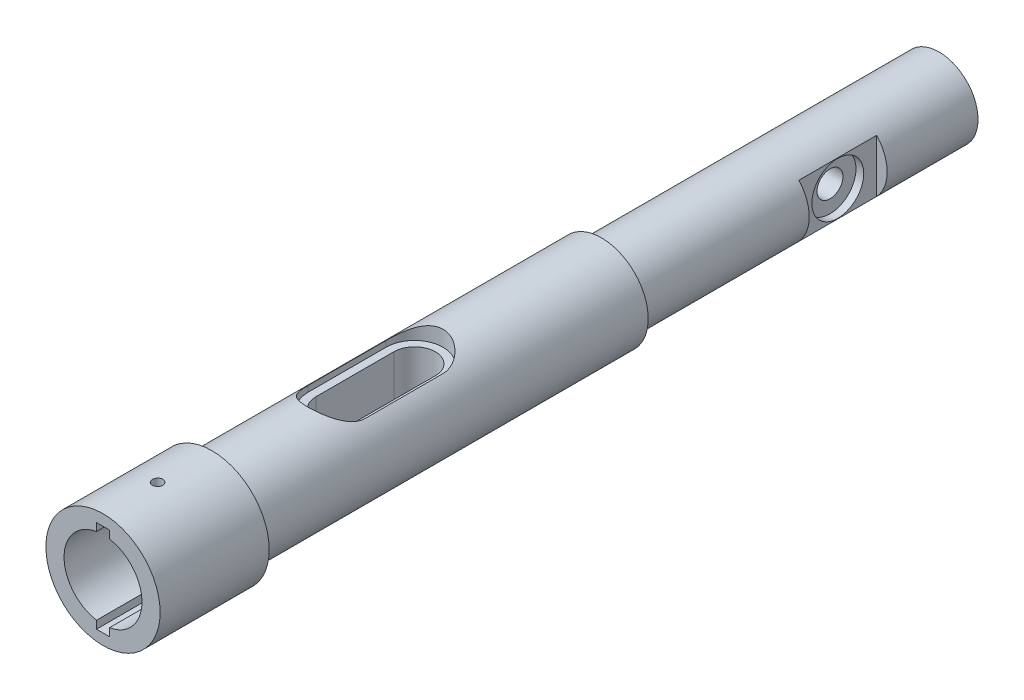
ISO-10303-21;
HEADER;
FILE_DESCRIPTION(('STEP AP214'),'2;1');
FILE_NAME('part.step','',(''),(''),'','','');
FILE_SCHEMA(('AUTOMOTIVE_DESIGN { 1 0 10303 214 1 1 1 1 }'));
ENDSEC;
DATA;
#1=APPLICATION_CONTEXT('core data for automotive mechanical design processes');
#2=APPLICATION_PROTOCOL_DEFINITION('international standard','automotive_design',2000,#1);
#3=PRODUCT_CONTEXT('',#1,'mechanical');
#4=PRODUCT('Part','Part','',(#3));
#5=PRODUCT_RELATED_PRODUCT_CATEGORY('part','',(#4));
#6=PRODUCT_DEFINITION_FORMATION('','',#4);
#7=PRODUCT_DEFINITION_CONTEXT('part definition',#1,'design');
#8=PRODUCT_DEFINITION('design','',#6,#7);
#9=PRODUCT_DEFINITION_SHAPE('','',#8);
#10=(LENGTH_UNIT() NAMED_UNIT(*) SI_UNIT(.MILLI.,.METRE.));
#11=(NAMED_UNIT(*) PLANE_ANGLE_UNIT() SI_UNIT($,.RADIAN.));
#12=(NAMED_UNIT(*) SI_UNIT($,.STERADIAN.) SOLID_ANGLE_UNIT());
#13=UNCERTAINTY_MEASURE_WITH_UNIT(LENGTH_MEASURE(1.E-05),#10,'distance_accuracy_value','');
#14=(GEOMETRIC_REPRESENTATION_CONTEXT(3) GLOBAL_UNCERTAINTY_ASSIGNED_CONTEXT((#13)) GLOBAL_UNIT_ASSIGNED_CONTEXT((#10,
#11,#12)) REPRESENTATION_CONTEXT('',''));
#15=CARTESIAN_POINT('',(0.,0.,0.));
#16=DIRECTION('',(0.,0.,1.));
#17=DIRECTION('',(1.,0.,0.));
#18=AXIS2_PLACEMENT_3D('',#15,#16,#17);
#19=CARTESIAN_POINT('',(0.,0.,-161.));
#20=DIRECTION('',(0.,0.,1.));
#21=DIRECTION('',(1.,0.,0.));
#22=AXIS2_PLACEMENT_3D('',#19,#20,#21);
#23=CYLINDRICAL_SURFACE('',#22,7.5);
#24=CARTESIAN_POINT('',(0.,0.,-96.));
#25=DIRECTION('',(0.,0.,1.));
#26=DIRECTION('',(1.,0.,0.));
#27=AXIS2_PLACEMENT_3D('',#24,#25,#26);
#28=CIRCLE('',#27,7.5);
#29=CARTESIAN_POINT('',(7.5,0.,-96.));
#30=VERTEX_POINT('',#29);
#31=EDGE_CURVE('E395',#30,#30,#28,.F.);
#32=ORIENTED_EDGE('',*,*,#31,.T.);
#33=EDGE_LOOP('',(#32));
#34=FACE_BOUND('',#33,.T.);
#35=CARTESIAN_POINT('',(0.,0.,-161.));
#36=DIRECTION('',(0.,0.,-1.));
#37=DIRECTION('',(-1.,0.,0.));
#38=AXIS2_PLACEMENT_3D('',#35,#36,#37);
#39=CIRCLE('',#38,7.5);
#40=CARTESIAN_POINT('',(-7.5,0.,-161.));
#41=VERTEX_POINT('',#40);
#42=EDGE_CURVE('E383',#41,#41,#39,.T.);
#43=ORIENTED_EDGE('',*,*,#42,.F.);
#44=EDGE_LOOP('',(#43));
#45=FACE_BOUND('',#44,.T.);
#46=CARTESIAN_POINT('',(0.,0.,-128.5));
#47=DIRECTION('',(0.,0.,1.));
#48=DIRECTION('',(1.,0.,0.));
#49=AXIS2_PLACEMENT_3D('',#46,#47,#48);
#50=CIRCLE('',#49,7.5);
#51=CARTESIAN_POINT('',(5.5,-5.09901951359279,-128.5));
#52=VERTEX_POINT('',#51);
#53=CARTESIAN_POINT('',(5.5,5.09901951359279,-128.5));
#54=VERTEX_POINT('',#53);
#55=EDGE_CURVE('E474',#52,#54,#50,.T.);
#56=ORIENTED_EDGE('',*,*,#55,.T.);
#57=DIRECTION('',(0.,0.,1.));
#58=VECTOR('',#57,1.);
#59=CARTESIAN_POINT('',(5.5,5.09901951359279,-161.));
#60=LINE('',#59,#58);
#61=CARTESIAN_POINT('',(5.5,5.09901951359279,-143.5));
#62=VERTEX_POINT('',#61);
#63=EDGE_CURVE('E300',#62,#54,#60,.T.);
#64=ORIENTED_EDGE('',*,*,#63,.F.);
#65=CARTESIAN_POINT('',(0.,0.,-143.5));
#66=DIRECTION('',(0.,0.,-1.));
#67=DIRECTION('',(-1.,0.,0.));
#68=AXIS2_PLACEMENT_3D('',#65,#66,#67);
#69=CIRCLE('',#68,7.5);
#70=CARTESIAN_POINT('',(5.5,-5.09901951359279,-143.5));
#71=VERTEX_POINT('',#70);
#72=EDGE_CURVE('E478',#62,#71,#69,.T.);
#73=ORIENTED_EDGE('',*,*,#72,.T.);
#74=DIRECTION('',(0.,0.,1.));
#75=VECTOR('',#74,1.);
#76=CARTESIAN_POINT('',(5.5,-5.09901951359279,-161.));
#77=LINE('',#76,#75);
#78=EDGE_CURVE('E298',#52,#71,#77,.F.);
#79=ORIENTED_EDGE('',*,*,#78,.F.);
#80=EDGE_LOOP('',(#56,#64,#73,#79));
#81=FACE_BOUND('',#80,.T.);
#82=DIRECTION('',(0.,0.,1.));
#83=VECTOR('',#82,1.);
#84=CARTESIAN_POINT('',(-5.5,5.09901951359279,-161.));
#85=LINE('',#84,#83);
#86=CARTESIAN_POINT('',(-5.5,5.09901951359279,-128.5));
#87=VERTEX_POINT('',#86);
#88=CARTESIAN_POINT('',(-5.5,5.09901951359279,-143.5));
#89=VERTEX_POINT('',#88);
#90=EDGE_CURVE('E287',#87,#89,#85,.F.);
#91=ORIENTED_EDGE('',*,*,#90,.F.);
#92=CARTESIAN_POINT('',(0.,0.,-128.5));
#93=DIRECTION('',(0.,0.,-1.));
#94=DIRECTION('',(-1.,0.,0.));
#95=AXIS2_PLACEMENT_3D('',#92,#93,#94);
#96=CIRCLE('',#95,7.5);
#97=CARTESIAN_POINT('',(-5.5,-5.09901951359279,-128.5));
#98=VERTEX_POINT('',#97);
#99=EDGE_CURVE('E56',#98,#87,#96,.T.);
#100=ORIENTED_EDGE('',*,*,#99,.F.);
#101=DIRECTION('',(0.,0.,1.));
#102=VECTOR('',#101,1.);
#103=CARTESIAN_POINT('',(-5.5,-5.09901951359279,-161.));
#104=LINE('',#103,#102);
#105=CARTESIAN_POINT('',(-5.5,-5.09901951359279,-143.5));
#106=VERTEX_POINT('',#105);
#107=EDGE_CURVE('E290',#106,#98,#104,.T.);
#108=ORIENTED_EDGE('',*,*,#107,.F.);
#109=CARTESIAN_POINT('',(0.,0.,-143.5));
#110=DIRECTION('',(0.,0.,1.));
#111=DIRECTION('',(1.,0.,0.));
#112=AXIS2_PLACEMENT_3D('',#109,#110,#111);
#113=CIRCLE('',#112,7.5);
#114=EDGE_CURVE('E14',#89,#106,#113,.T.);
#115=ORIENTED_EDGE('',*,*,#114,.F.);
#116=EDGE_LOOP('',(#91,#100,#108,#115));
#117=FACE_BOUND('',#116,.T.);
#118=ADVANCED_FACE('F46',(#34,#45,#81,#117),#23,.T.);
#119=CARTESIAN_POINT('',(7.5,0.,-136.));
#120=DIRECTION('',(1.,0.,0.));
#121=DIRECTION('',(0.,0.,-1.));
#122=AXIS2_PLACEMENT_3D('',#119,#120,#121);
#123=CYLINDRICAL_SURFACE('',#122,5.00000000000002);
#124=CARTESIAN_POINT('',(-4.,0.,-136.));
#125=DIRECTION('',(1.,0.,0.));
#126=DIRECTION('',(0.,0.,-1.));
#127=AXIS2_PLACEMENT_3D('',#124,#125,#126);
#128=CIRCLE('',#127,5.00000000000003);
#129=CARTESIAN_POINT('',(-4.,0.,-141.));
#130=VERTEX_POINT('',#129);
#131=EDGE_CURVE('E303',#130,#130,#128,.T.);
#132=ORIENTED_EDGE('',*,*,#131,.T.);
#133=EDGE_LOOP('',(#132));
#134=FACE_BOUND('',#133,.T.);
#135=CARTESIAN_POINT('',(-5.5,0.,-136.));
#136=DIRECTION('',(-1.,0.,0.));
#137=DIRECTION('',(0.,0.,1.));
#138=AXIS2_PLACEMENT_3D('',#135,#136,#137);
#139=CIRCLE('',#138,5.00000000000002);
#140=CARTESIAN_POINT('',(-5.5,0.,-131.));
#141=VERTEX_POINT('',#140);
#142=EDGE_CURVE('E286',#141,#141,#139,.F.);
#143=ORIENTED_EDGE('',*,*,#142,.F.);
#144=EDGE_LOOP('',(#143));
#145=FACE_BOUND('',#144,.T.);
#146=ADVANCED_FACE('F488',(#134,#145),#123,.F.);
#147=CARTESIAN_POINT('',(7.5,0.,-136.));
#148=DIRECTION('',(1.,0.,0.));
#149=DIRECTION('',(0.,0.,-1.));
#150=AXIS2_PLACEMENT_3D('',#147,#148,#149);
#151=CYLINDRICAL_SURFACE('',#150,5.);
#152=CARTESIAN_POINT('',(4.,0.,-136.));
#153=DIRECTION('',(1.,0.,0.));
#154=DIRECTION('',(0.,0.,-1.));
#155=AXIS2_PLACEMENT_3D('',#152,#153,#154);
#156=CIRCLE('',#155,5.);
#157=CARTESIAN_POINT('',(4.,0.,-141.));
#158=VERTEX_POINT('',#157);
#159=EDGE_CURVE('E312',#158,#158,#156,.T.);
#160=ORIENTED_EDGE('',*,*,#159,.F.);
#161=EDGE_LOOP('',(#160));
#162=FACE_BOUND('',#161,.T.);
#163=CARTESIAN_POINT('',(5.5,0.,-136.));
#164=DIRECTION('',(1.,0.,0.));
#165=DIRECTION('',(0.,0.,-1.));
#166=AXIS2_PLACEMENT_3D('',#163,#164,#165);
#167=CIRCLE('',#166,5.);
#168=CARTESIAN_POINT('',(5.5,0.,-141.));
#169=VERTEX_POINT('',#168);
#170=EDGE_CURVE('E297',#169,#169,#167,.F.);
#171=ORIENTED_EDGE('',*,*,#170,.F.);
#172=EDGE_LOOP('',(#171));
#173=FACE_BOUND('',#172,.T.);
#174=ADVANCED_FACE('F490',(#162,#173),#151,.F.);
#175=CARTESIAN_POINT('',(-4.,-11.,-60.));
#176=DIRECTION('',(-1.,0.,0.));
#177=DIRECTION('',(0.,0.,1.));
#178=AXIS2_PLACEMENT_3D('',#175,#176,#177);
#179=PLANE('',#178);
#180=DIRECTION('',(0.,0.,1.));
#181=VECTOR('',#180,1.);
#182=CARTESIAN_POINT('',(-4.,-6.,-60.));
#183=LINE('',#182,#181);
#184=CARTESIAN_POINT('',(-4.,-6.,-60.));
#185=VERTEX_POINT('',#184);
#186=CARTESIAN_POINT('',(-4.,-6.,-45.));
#187=VERTEX_POINT('',#186);
#188=EDGE_CURVE('E339',#185,#187,#183,.T.);
#189=ORIENTED_EDGE('',*,*,#188,.F.);
#190=DIRECTION('',(0.,1.,0.));
#191=VECTOR('',#190,1.);
#192=CARTESIAN_POINT('',(-4.,-11.,-60.));
#193=LINE('',#192,#191);
#194=CARTESIAN_POINT('',(-4.,6.,-60.));
#195=VERTEX_POINT('',#194);
#196=EDGE_CURVE('E388',#185,#195,#193,.T.);
#197=ORIENTED_EDGE('',*,*,#196,.T.);
#198=DIRECTION('',(0.,0.,-1.));
#199=VECTOR('',#198,1.);
#200=CARTESIAN_POINT('',(-4.,6.,-60.));
#201=LINE('',#200,#199);
#202=CARTESIAN_POINT('',(-4.,6.,-45.));
#203=VERTEX_POINT('',#202);
#204=EDGE_CURVE('E371',#203,#195,#201,.T.);
#205=ORIENTED_EDGE('',*,*,#204,.F.);
#206=DIRECTION('',(0.,1.,0.));
#207=VECTOR('',#206,1.);
#208=CARTESIAN_POINT('',(-4.,-11.,-45.));
#209=LINE('',#208,#207);
#210=EDGE_CURVE('E386',#187,#203,#209,.T.);
#211=ORIENTED_EDGE('',*,*,#210,.F.);
#212=EDGE_LOOP('',(#189,#197,#205,#211));
#213=FACE_BOUND('',#212,.T.);
#214=ADVANCED_FACE('F497',(#213),#179,.F.);
#215=CARTESIAN_POINT('',(0.,-11.,-45.));
#216=DIRECTION('',(0.,1.,0.));
#217=DIRECTION('',(0.,0.,1.));
#218=AXIS2_PLACEMENT_3D('',#215,#216,#217);
#219=CYLINDRICAL_SURFACE('',#218,4.);
#220=CARTESIAN_POINT('',(0.,-6.,-45.));
#221=DIRECTION('',(0.,-1.,0.));
#222=DIRECTION('',(1.,0.,0.));
#223=AXIS2_PLACEMENT_3D('',#220,#221,#222);
#224=CIRCLE('',#223,4.);
#225=CARTESIAN_POINT('',(4.,-6.,-45.));
#226=VERTEX_POINT('',#225);
#227=EDGE_CURVE('E337',#187,#226,#224,.F.);
#228=ORIENTED_EDGE('',*,*,#227,.F.);
#229=ORIENTED_EDGE('',*,*,#210,.T.);
#230=CARTESIAN_POINT('',(0.,6.,-45.));
#231=DIRECTION('',(0.,1.,0.));
#232=DIRECTION('',(-1.,0.,0.));
#233=AXIS2_PLACEMENT_3D('',#230,#231,#232);
#234=CIRCLE('',#233,4.);
#235=CARTESIAN_POINT('',(4.,6.,-45.));
#236=VERTEX_POINT('',#235);
#237=EDGE_CURVE('E368',#236,#203,#234,.F.);
#238=ORIENTED_EDGE('',*,*,#237,.F.);
#239=DIRECTION('',(0.,1.,0.));
#240=VECTOR('',#239,1.);
#241=CARTESIAN_POINT('',(4.,-11.,-45.));
#242=LINE('',#241,#240);
#243=EDGE_CURVE('E384',#226,#236,#242,.T.);
#244=ORIENTED_EDGE('',*,*,#243,.F.);
#245=EDGE_LOOP('',(#228,#229,#238,#244));
#246=FACE_BOUND('',#245,.T.);
#247=ADVANCED_FACE('F533',(#246),#219,.F.);
#248=CARTESIAN_POINT('',(4.,-11.,-45.));
#249=DIRECTION('',(1.,0.,0.));
#250=DIRECTION('',(0.,0.,-1.));
#251=AXIS2_PLACEMENT_3D('',#248,#249,#250);
#252=PLANE('',#251);
#253=DIRECTION('',(0.,0.,-1.));
#254=VECTOR('',#253,1.);
#255=CARTESIAN_POINT('',(4.,-6.,-45.));
#256=LINE('',#255,#254);
#257=CARTESIAN_POINT('',(4.,-6.,-60.));
#258=VERTEX_POINT('',#257);
#259=EDGE_CURVE('E328',#226,#258,#256,.T.);
#260=ORIENTED_EDGE('',*,*,#259,.F.);
#261=ORIENTED_EDGE('',*,*,#243,.T.);
#262=DIRECTION('',(0.,0.,1.));
#263=VECTOR('',#262,1.);
#264=CARTESIAN_POINT('',(4.,6.,-45.));
#265=LINE('',#264,#263);
#266=CARTESIAN_POINT('',(4.,6.,-60.));
#267=VERTEX_POINT('',#266);
#268=EDGE_CURVE('E357',#267,#236,#265,.T.);
#269=ORIENTED_EDGE('',*,*,#268,.F.);
#270=DIRECTION('',(0.,1.,0.));
#271=VECTOR('',#270,1.);
#272=CARTESIAN_POINT('',(4.,-11.,-60.));
#273=LINE('',#272,#271);
#274=EDGE_CURVE('E381',#258,#267,#273,.T.);
#275=ORIENTED_EDGE('',*,*,#274,.F.);
#276=EDGE_LOOP('',(#260,#261,#269,#275));
#277=FACE_BOUND('',#276,.T.);
#278=ADVANCED_FACE('F543',(#277),#252,.F.);
#279=CARTESIAN_POINT('',(0.,-11.,-60.));
#280=DIRECTION('',(0.,1.,0.));
#281=DIRECTION('',(0.,0.,1.));
#282=AXIS2_PLACEMENT_3D('',#279,#280,#281);
#283=CYLINDRICAL_SURFACE('',#282,4.);
#284=CARTESIAN_POINT('',(0.,-6.,-60.));
#285=DIRECTION('',(0.,-1.,0.));
#286=DIRECTION('',(1.,0.,0.));
#287=AXIS2_PLACEMENT_3D('',#284,#285,#286);
#288=CIRCLE('',#287,4.);
#289=EDGE_CURVE('E472',#258,#185,#288,.F.);
#290=ORIENTED_EDGE('',*,*,#289,.F.);
#291=ORIENTED_EDGE('',*,*,#274,.T.);
#292=CARTESIAN_POINT('',(0.,6.,-60.));
#293=DIRECTION('',(0.,1.,0.));
#294=DIRECTION('',(-1.,0.,0.));
#295=AXIS2_PLACEMENT_3D('',#292,#293,#294);
#296=CIRCLE('',#295,4.);
#297=EDGE_CURVE('E398',#195,#267,#296,.F.);
#298=ORIENTED_EDGE('',*,*,#297,.F.);
#299=ORIENTED_EDGE('',*,*,#196,.F.);
#300=EDGE_LOOP('',(#290,#291,#298,#299));
#301=FACE_BOUND('',#300,.T.);
#302=ADVANCED_FACE('F540',(#301),#283,.F.);
#303=CARTESIAN_POINT('',(0.,0.,-21.));
#304=DIRECTION('',(0.,0.,-1.));
#305=DIRECTION('',(-1.,0.,0.));
#306=AXIS2_PLACEMENT_3D('',#303,#304,#305);
#307=CYLINDRICAL_SURFACE('',#306,9.);
#308=DIRECTION('',(0.,0.,-1.));
#309=VECTOR('',#308,1.);
#310=CARTESIAN_POINT('',(-5.5,7.12390342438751,-21.));
#311=LINE('',#310,#309);
#312=CARTESIAN_POINT('',(-5.5,7.12390342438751,-60.));
#313=VERTEX_POINT('',#312);
#314=CARTESIAN_POINT('',(-5.5,7.12390342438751,-45.));
#315=VERTEX_POINT('',#314);
#316=EDGE_CURVE('E437',#313,#315,#311,.F.);
#317=ORIENTED_EDGE('',*,*,#316,.F.);
#318=CARTESIAN_POINT('',(5.5,7.12390342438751,-60.));
#319=CARTESIAN_POINT('',(5.50003164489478,7.12384227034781,-60.1384837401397));
#320=CARTESIAN_POINT('',(5.49477101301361,7.12793985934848,-60.2769311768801));
#321=CARTESIAN_POINT('',(5.4739175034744,7.14398614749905,-60.5524495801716));
#322=CARTESIAN_POINT('',(5.45833523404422,7.15592678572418,-60.6895218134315));
#323=CARTESIAN_POINT('',(5.41726079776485,7.18706494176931,-60.9601484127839));
#324=CARTESIAN_POINT('',(5.39185186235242,7.20620147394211,-61.0937225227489));
#325=CARTESIAN_POINT('',(5.33153722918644,7.25093954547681,-61.3575886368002));
#326=CARTESIAN_POINT('',(5.29662950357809,7.27654246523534,-61.4878799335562));
#327=CARTESIAN_POINT('',(5.17863986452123,7.36145832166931,-61.8716321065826));
#328=CARTESIAN_POINT('',(5.082089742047,7.42904169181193,-62.1192604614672));
#329=CARTESIAN_POINT('',(4.85653609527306,7.57841366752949,-62.5949433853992));
#330=CARTESIAN_POINT('',(4.72745601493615,7.66023563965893,-62.8229500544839));
#331=CARTESIAN_POINT('',(4.42144634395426,7.84131299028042,-63.2843114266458));
#332=CARTESIAN_POINT('',(4.24052999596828,7.94146449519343,-63.5146962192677));
#333=CARTESIAN_POINT('',(3.94352964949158,8.09079313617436,-63.8366571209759));
#334=CARTESIAN_POINT('',(3.84019994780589,8.14044440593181,-63.9400875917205));
#335=CARTESIAN_POINT('',(3.62524059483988,8.23841994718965,-64.1387240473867));
#336=CARTESIAN_POINT('',(3.51360951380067,8.28674398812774,-64.2339286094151));
#337=CARTESIAN_POINT('',(3.26925679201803,8.3863759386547,-64.4259216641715));
#338=CARTESIAN_POINT('',(3.13558220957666,8.43739484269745,-64.5216505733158));
#339=CARTESIAN_POINT('',(2.85910655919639,8.53504477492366,-64.7013482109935));
#340=CARTESIAN_POINT('',(2.71630931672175,8.58167762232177,-64.7853218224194));
#341=CARTESIAN_POINT('',(2.42238384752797,8.66923054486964,-64.9406142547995));
#342=CARTESIAN_POINT('',(2.27125902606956,8.71015293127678,-65.0119381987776));
#343=CARTESIAN_POINT('',(1.96166720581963,8.78505599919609,-65.1410089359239));
#344=CARTESIAN_POINT('',(1.80320147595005,8.81903787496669,-65.1987580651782));
#345=CARTESIAN_POINT('',(1.49609836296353,8.87601451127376,-65.2948064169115));
#346=CARTESIAN_POINT('',(1.3480229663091,8.89976030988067,-65.3344583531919));
#347=CARTESIAN_POINT('',(1.04814707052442,8.9400370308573,-65.4013867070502));
#348=CARTESIAN_POINT('',(0.896347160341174,8.95656908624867,-65.4286650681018));
#349=CARTESIAN_POINT('',(0.590473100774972,8.98191929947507,-65.4703883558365));
#350=CARTESIAN_POINT('',(0.436400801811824,8.99074341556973,-65.4848431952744));
#351=CARTESIAN_POINT('',(0.127342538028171,9.00042645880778,-65.5007015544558));
#352=CARTESIAN_POINT('',(-0.0276433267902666,9.00128624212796,-65.5021064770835));
#353=CARTESIAN_POINT('',(-0.317062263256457,8.99542377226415,-65.4925091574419));
#354=CARTESIAN_POINT('',(-0.451570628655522,8.98966411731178,-65.4830821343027));
#355=CARTESIAN_POINT('',(-0.71919380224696,8.97222082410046,-65.454436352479));
#356=CARTESIAN_POINT('',(-0.852308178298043,8.96053540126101,-65.435214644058));
#357=CARTESIAN_POINT('',(-1.11613089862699,8.93150885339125,-65.3872272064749));
#358=CARTESIAN_POINT('',(-1.24684004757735,8.91416965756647,-65.3584647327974));
#359=CARTESIAN_POINT('',(-1.50508429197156,8.87422297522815,-65.2917424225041));
#360=CARTESIAN_POINT('',(-1.63261814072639,8.85161345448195,-65.2537790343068));
#361=CARTESIAN_POINT('',(-2.01031234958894,8.7763611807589,-65.1263341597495));
#362=CARTESIAN_POINT('',(-2.2546559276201,8.71639936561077,-65.0234662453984));
#363=CARTESIAN_POINT('',(-2.72272514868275,8.58174150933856,-64.7860025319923));
#364=CARTESIAN_POINT('',(-2.94644651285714,8.507042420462,-64.651400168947));
#365=CARTESIAN_POINT('',(-3.39626396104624,8.33845458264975,-64.3358694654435));
#366=CARTESIAN_POINT('',(-3.61934084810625,8.24333691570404,-64.151298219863));
#367=CARTESIAN_POINT('',(-4.03342507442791,8.04884445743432,-63.7502949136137));
#368=CARTESIAN_POINT('',(-4.22437704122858,7.94946267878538,-63.5338090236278));
#369=CARTESIAN_POINT('',(-4.49492377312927,7.79795853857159,-63.1736305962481));
#370=CARTESIAN_POINT('',(-4.586663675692,7.74419973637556,-63.0395784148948));
#371=CARTESIAN_POINT('',(-4.75845465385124,7.63984275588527,-62.7629006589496));
#372=CARTESIAN_POINT('',(-4.83850248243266,7.58924545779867,-62.6202727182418));
#373=CARTESIAN_POINT('',(-4.98591124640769,7.4932243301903,-62.3275444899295));
#374=CARTESIAN_POINT('',(-5.05331134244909,7.4477847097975,-62.1774691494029));
#375=CARTESIAN_POINT('',(-5.17487248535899,7.36384098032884,-61.8702778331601));
#376=CARTESIAN_POINT('',(-5.22904441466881,7.32533117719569,-61.7131677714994));
#377=CARTESIAN_POINT('',(-5.31260284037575,7.26486576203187,-61.4293003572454));
#378=CARTESIAN_POINT('',(-5.34482420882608,7.24113674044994,-61.3037495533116));
#379=CARTESIAN_POINT('',(-5.40045466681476,7.19974210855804,-61.0497546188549));
#380=CARTESIAN_POINT('',(-5.42386682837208,7.18207438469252,-60.9213115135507));
#381=CARTESIAN_POINT('',(-5.4616816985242,7.15336540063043,-60.6613551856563));
#382=CARTESIAN_POINT('',(-5.47601471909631,7.14237542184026,-60.5298260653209));
#383=CARTESIAN_POINT('',(-5.4951926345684,7.12761438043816,-60.2655413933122));
#384=CARTESIAN_POINT('',(-5.50002759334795,7.12385087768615,-60.1327847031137));
#385=CARTESIAN_POINT('',(-5.5,7.1239034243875,-60.));
#386=B_SPLINE_CURVE_WITH_KNOTS('',3,(#318,#319,#320,#321,#322,#323,#324,#325,#326,#327,#328,
#329,#330,#331,#332,#333,#334,#335,#336,#337,#338,#339,#340,#341,#342,#343,#344,#345,#346,#347,
#348,#349,#350,#351,#352,#353,#354,#355,#356,#357,#358,#359,#360,#361,#362,#363,#364,#365,#366,
#367,#368,#369,#370,#371,#372,#373,#374,#375,#376,#377,#378,#379,#380,#381,#382,#383,#384,#385),
.UNSPECIFIED.,.F.,.F.,(4,2,2,2,2,2,2,2,2,2,2,2,2,2,2,2,2,2,2,2,2,2,2,2,2,2,2,2,2,2,2,2,2,4),(0.,
0.415231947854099,0.830037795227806,1.24140459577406,1.65285928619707,2.47187347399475,
3.29283343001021,4.21761057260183,4.68046646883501,5.14340226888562,5.65917880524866,
6.17474045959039,6.69009283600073,7.20535646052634,7.67004523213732,8.13466099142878,
8.59891728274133,9.06312366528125,9.46752164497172,9.87204148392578,10.2764234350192,
10.6809617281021,11.4927980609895,12.3048024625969,13.2155449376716,14.1278414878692,
14.6406120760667,15.1535247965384,15.6648222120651,16.1756975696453,16.5705931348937,
16.9653508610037,17.3631030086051,17.7612710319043),.UNSPECIFIED.);
#387=CARTESIAN_POINT('',(5.5,7.12390342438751,-60.));
#388=VERTEX_POINT('',#387);
#389=EDGE_CURVE('E432',#388,#313,#386,.T.);
#390=ORIENTED_EDGE('',*,*,#389,.F.);
#391=DIRECTION('',(0.,0.,-1.));
#392=VECTOR('',#391,1.);
#393=CARTESIAN_POINT('',(5.5,7.12390342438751,-21.));
#394=LINE('',#393,#392);
#395=CARTESIAN_POINT('',(5.5,7.12390342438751,-45.));
#396=VERTEX_POINT('',#395);
#397=EDGE_CURVE('E409',#396,#388,#394,.T.);
#398=ORIENTED_EDGE('',*,*,#397,.F.);
#399=CARTESIAN_POINT('',(-5.5,7.1239034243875,-45.));
#400=CARTESIAN_POINT('',(-5.49999845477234,7.12390581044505,-44.8624771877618));
#401=CARTESIAN_POINT('',(-5.49483123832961,7.12790327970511,-44.7249113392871));
#402=CARTESIAN_POINT('',(-5.47425167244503,7.14371961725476,-44.4509405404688));
#403=CARTESIAN_POINT('',(-5.4588324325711,7.15554374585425,-44.3145364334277));
#404=CARTESIAN_POINT('',(-5.41796990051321,7.18653319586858,-44.0437659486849));
#405=CARTESIAN_POINT('',(-5.39250405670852,7.20571503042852,-43.9094048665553));
#406=CARTESIAN_POINT('',(-5.33195351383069,7.25063339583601,-43.6439627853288));
#407=CARTESIAN_POINT('',(-5.2968640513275,7.27637317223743,-43.5128834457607));
#408=CARTESIAN_POINT('',(-5.17854500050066,7.36152756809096,-43.1280583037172));
#409=CARTESIAN_POINT('',(-5.08186199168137,7.42920355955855,-42.8801438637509));
#410=CARTESIAN_POINT('',(-4.85621410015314,7.57861585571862,-42.4044936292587));
#411=CARTESIAN_POINT('',(-4.72725105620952,7.66035135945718,-42.1767566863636));
#412=CARTESIAN_POINT('',(-4.42151893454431,7.84127630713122,-41.7157802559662));
#413=CARTESIAN_POINT('',(-4.2407501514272,7.94136221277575,-41.4855444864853));
#414=CARTESIAN_POINT('',(-3.84455804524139,8.14054660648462,-41.0560514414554));
#415=CARTESIAN_POINT('',(-3.62910564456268,8.23964419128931,-40.8568204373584));
#416=CARTESIAN_POINT('',(-3.26922487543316,8.38639319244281,-40.574052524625));
#417=CARTESIAN_POINT('',(-3.13556585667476,8.43740241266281,-40.4783370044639));
#418=CARTESIAN_POINT('',(-2.85909539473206,8.53504692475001,-40.2986463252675));
#419=CARTESIAN_POINT('',(-2.71628780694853,8.58168403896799,-40.2146662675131));
#420=CARTESIAN_POINT('',(-2.42235745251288,8.66923839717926,-40.0593723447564));
#421=CARTESIAN_POINT('',(-2.27123862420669,8.71015831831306,-39.9880525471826));
#422=CARTESIAN_POINT('',(-1.96165745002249,8.7850579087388,-39.8589877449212));
#423=CARTESIAN_POINT('',(-1.80319637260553,8.81903877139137,-39.8012404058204));
#424=CARTESIAN_POINT('',(-1.49609801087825,8.87601462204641,-39.7051934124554));
#425=CARTESIAN_POINT('',(-1.34802246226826,8.89976040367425,-39.6655414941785));
#426=CARTESIAN_POINT('',(-1.04814613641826,8.94003713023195,-39.5986131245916));
#427=CARTESIAN_POINT('',(-0.896345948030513,8.95656920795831,-39.5713347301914));
#428=CARTESIAN_POINT('',(-0.590471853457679,8.98191938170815,-39.529611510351));
#429=CARTESIAN_POINT('',(-0.436399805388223,8.99074346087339,-39.5151567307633));
#430=CARTESIAN_POINT('',(-0.127342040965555,9.00042646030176,-39.4992984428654));
#431=CARTESIAN_POINT('',(0.0276435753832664,9.0012862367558,-39.497893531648));
#432=CARTESIAN_POINT('',(0.31706206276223,8.99542377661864,-39.5074908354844));
#433=CARTESIAN_POINT('',(0.451570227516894,8.98966413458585,-39.5169178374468));
#434=CARTESIAN_POINT('',(0.719193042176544,8.97222088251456,-39.5455635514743));
#435=CARTESIAN_POINT('',(0.852307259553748,8.9605354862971,-39.564785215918));
#436=CARTESIAN_POINT('',(1.11613001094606,8.93150896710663,-39.6127726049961));
#437=CARTESIAN_POINT('',(1.24683934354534,8.91416975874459,-39.6415350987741));
#438=CARTESIAN_POINT('',(1.50508394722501,8.87422303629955,-39.7082574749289));
#439=CARTESIAN_POINT('',(1.63261797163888,8.85161348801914,-39.7462209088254));
#440=CARTESIAN_POINT('',(2.01030752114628,8.77636214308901,-39.8736642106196));
#441=CARTESIAN_POINT('',(2.25464656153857,8.71640166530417,-39.9765298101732));
#442=CARTESIAN_POINT('',(2.72271654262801,8.58174438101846,-40.2139922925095));
#443=CARTESIAN_POINT('',(2.9464424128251,8.50704396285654,-40.3485969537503));
#444=CARTESIAN_POINT('',(3.39629886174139,8.33844149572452,-40.6641550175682));
#445=CARTESIAN_POINT('',(3.61940638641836,8.24330894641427,-40.8487560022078));
#446=CARTESIAN_POINT('',(4.03348113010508,8.04881530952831,-41.2497686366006));
#447=CARTESIAN_POINT('',(4.22440248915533,7.94944843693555,-41.4662248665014));
#448=CARTESIAN_POINT('',(4.49484143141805,7.79800464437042,-41.8262597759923));
#449=CARTESIAN_POINT('',(4.58650845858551,7.74429068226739,-41.9601947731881));
#450=CARTESIAN_POINT('',(4.75816517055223,7.64002193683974,-42.2366100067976));
#451=CARTESIAN_POINT('',(4.83815281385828,7.58946770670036,-42.379091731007));
#452=CARTESIAN_POINT('',(4.98558704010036,7.49344100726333,-42.6717532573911));
#453=CARTESIAN_POINT('',(5.05305242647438,7.44796096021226,-42.8219210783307));
#454=CARTESIAN_POINT('',(5.17475243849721,7.36392641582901,-43.1293744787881));
#455=CARTESIAN_POINT('',(5.22899246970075,7.32536909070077,-43.2866571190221));
#456=CARTESIAN_POINT('',(5.31133892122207,7.26578013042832,-43.5664048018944));
#457=CARTESIAN_POINT('',(5.34258296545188,7.2427859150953,-43.6875363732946));
#458=CARTESIAN_POINT('',(5.39687398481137,7.20242313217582,-43.9325341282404));
#459=CARTESIAN_POINT('',(5.41992284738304,7.1850532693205,-44.0563996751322));
#460=CARTESIAN_POINT('',(5.45749723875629,7.15655515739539,-44.3060007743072));
#461=CARTESIAN_POINT('',(5.47203156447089,7.14542046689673,-44.4317342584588));
#462=CARTESIAN_POINT('',(5.49239476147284,7.1297802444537,-44.6843226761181));
#463=CARTESIAN_POINT('',(5.49822346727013,7.12527483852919,-44.8111776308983));
#464=CARTESIAN_POINT('',(5.5010826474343,7.12306769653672,-45.065270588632));
#465=CARTESIAN_POINT('',(5.49809761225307,7.12537795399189,-45.1925088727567));
#466=CARTESIAN_POINT('',(5.48334548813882,7.13673645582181,-45.446167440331));
#467=CARTESIAN_POINT('',(5.47157835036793,7.14578473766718,-45.5725877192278));
#468=CARTESIAN_POINT('',(5.43943460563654,7.17028302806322,-45.8237633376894));
#469=CARTESIAN_POINT('',(5.41905369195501,7.18573623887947,-45.9485178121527));
#470=CARTESIAN_POINT('',(5.36997285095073,7.22248732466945,-46.1955218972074));
#471=CARTESIAN_POINT('',(5.34126951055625,7.24378759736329,-46.3177704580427));
#472=CARTESIAN_POINT('',(5.24371535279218,7.31504898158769,-46.6777442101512));
#473=CARTESIAN_POINT('',(5.16312940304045,7.37260625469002,-46.9109006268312));
#474=CARTESIAN_POINT('',(4.9735104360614,7.50181920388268,-47.36092953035));
#475=CARTESIAN_POINT('',(4.86446700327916,7.57348003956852,-47.5777960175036));
#476=CARTESIAN_POINT('',(4.59779111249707,7.73881471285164,-48.0318081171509));
#477=CARTESIAN_POINT('',(4.4349010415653,7.83410800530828,-48.2652783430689));
#478=CARTESIAN_POINT('',(4.07551006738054,8.02694185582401,-48.7041479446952));
#479=CARTESIAN_POINT('',(3.87897563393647,8.12448457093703,-48.9095189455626));
#480=CARTESIAN_POINT('',(3.54593780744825,8.27308898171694,-49.2074662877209));
#481=CARTESIAN_POINT('',(3.41972469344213,8.32618258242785,-49.3107087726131));
#482=CARTESIAN_POINT('',(3.15775429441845,8.42901870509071,-49.5061370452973));
#483=CARTESIAN_POINT('',(3.02200048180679,8.47876243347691,-49.5983268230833));
#484=CARTESIAN_POINT('',(2.74160740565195,8.57353430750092,-49.7708153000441));
#485=CARTESIAN_POINT('',(2.59696967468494,8.61856326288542,-49.8511160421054));
#486=CARTESIAN_POINT('',(2.29962963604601,8.70261785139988,-49.9989253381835));
#487=CARTESIAN_POINT('',(2.14692840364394,8.74164428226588,-50.0664355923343));
#488=CARTESIAN_POINT('',(1.84509008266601,8.81010505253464,-50.1836334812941));
#489=CARTESIAN_POINT('',(1.69640739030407,8.84000884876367,-50.2342161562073));
#490=CARTESIAN_POINT('',(1.39409763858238,8.89269479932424,-50.3227142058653));
#491=CARTESIAN_POINT('',(1.24047138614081,8.91547810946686,-50.3606316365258));
#492=CARTESIAN_POINT('',(0.92973869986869,8.95321485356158,-50.4231612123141));
#493=CARTESIAN_POINT('',(0.772635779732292,8.96817584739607,-50.4477862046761));
#494=CARTESIAN_POINT('',(0.456330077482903,8.98982078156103,-50.483345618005));
#495=CARTESIAN_POINT('',(0.297127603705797,8.9965059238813,-50.4942820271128));
#496=CARTESIAN_POINT('',(0.000589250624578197,9.0010455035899,-50.5017108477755));
#497=CARTESIAN_POINT('',(-0.136688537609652,9.00000491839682,-50.5000105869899));
#498=CARTESIAN_POINT('',(-0.4105405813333,8.99167483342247,-50.4863691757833));
#499=CARTESIAN_POINT('',(-0.547114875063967,8.98438567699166,-50.4744285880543));
#500=CARTESIAN_POINT('',(-0.818526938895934,8.96373462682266,-50.4404705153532));
#501=CARTESIAN_POINT('',(-0.953364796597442,8.95037304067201,-50.4184535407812));
#502=CARTESIAN_POINT('',(-1.22036251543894,8.91789239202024,-50.3646308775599));
#503=CARTESIAN_POINT('',(-1.35252230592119,8.89877317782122,-50.3328249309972));
#504=CARTESIAN_POINT('',(-1.6101504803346,8.85573555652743,-50.2606910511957));
#505=CARTESIAN_POINT('',(-1.73570341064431,8.83194473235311,-50.2205884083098));
#506=CARTESIAN_POINT('',(-1.98279033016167,8.77977875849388,-50.1318414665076));
#507=CARTESIAN_POINT('',(-2.10432291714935,8.75140202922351,-50.0831942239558));
#508=CARTESIAN_POINT('',(-2.46191750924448,8.66021535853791,-49.9251185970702));
#509=CARTESIAN_POINT('',(-2.6911680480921,8.59131566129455,-49.803501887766));
#510=CARTESIAN_POINT('',(-3.15097273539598,8.43425390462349,-49.5169150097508));
#511=CARTESIAN_POINT('',(-3.37904852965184,8.34482025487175,-49.3487008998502));
#512=CARTESIAN_POINT('',(-3.80550510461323,8.15918499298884,-48.9808962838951));
#513=CARTESIAN_POINT('',(-4.00385102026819,8.06297562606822,-48.7812694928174));
#514=CARTESIAN_POINT('',(-4.39276010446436,7.85863478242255,-48.3249510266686));
#515=CARTESIAN_POINT('',(-4.57865840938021,7.75064708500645,-48.0641938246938));
#516=CARTESIAN_POINT('',(-4.90425515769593,7.54884147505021,-47.5102434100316));
#517=CARTESIAN_POINT('',(-5.04398713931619,7.45501330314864,-47.2170739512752));
#518=CARTESIAN_POINT('',(-5.24586017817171,7.31387004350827,-46.6719435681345));
#519=CARTESIAN_POINT('',(-5.31835270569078,7.26084930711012,-46.4253571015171));
#520=CARTESIAN_POINT('',(-5.40090157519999,7.1994019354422,-46.047333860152));
#521=CARTESIAN_POINT('',(-5.42404228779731,7.18194229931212,-45.9201065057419));
#522=CARTESIAN_POINT('',(-5.4613487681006,7.15361703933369,-45.6636427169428));
#523=CARTESIAN_POINT('',(-5.47551974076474,7.14274759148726,-45.5344074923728));
#524=CARTESIAN_POINT('',(-5.49005511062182,7.13157254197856,-45.3374174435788));
#525=CARTESIAN_POINT('',(-5.49378196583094,7.12870043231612,-45.2700308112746));
#526=CARTESIAN_POINT('',(-5.49875501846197,7.12486511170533,-45.1350995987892));
#527=CARTESIAN_POINT('',(-5.50000075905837,7.12390225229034,-45.0675549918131));
#528=CARTESIAN_POINT('',(-5.5,7.1239034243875,-45.));
#529=B_SPLINE_CURVE_WITH_KNOTS('',3,(#399,#400,#401,#402,#403,#404,#405,#406,#407,#408,#409,
#410,#411,#412,#413,#414,#415,#416,#417,#418,#419,#420,#421,#422,#423,#424,#425,#426,#427,#428,
#429,#430,#431,#432,#433,#434,#435,#436,#437,#438,#439,#440,#441,#442,#443,#444,#445,#446,#447,
#448,#449,#450,#451,#452,#453,#454,#455,#456,#457,#458,#459,#460,#461,#462,#463,#464,#465,#466,
#467,#468,#469,#470,#471,#472,#473,#474,#475,#476,#477,#478,#479,#480,#481,#482,#483,#484,#485,
#486,#487,#488,#489,#490,#491,#492,#493,#494,#495,#496,#497,#498,#499,#500,#501,#502,#503,#504,
#505,#506,#507,#508,#509,#510,#511,#512,#513,#514,#515,#516,#517,#518,#519,#520,#521,#522,#523,
#524,#525,#526,#527,#528),.UNSPECIFIED.,.T.,.F.,(4,2,2,2,2,2,2,2,2,2,2,2,2,2,2,2,2,2,2,2,2,2,2,
2,2,2,2,2,2,2,2,2,2,2,2,2,2,2,2,2,2,2,2,2,2,2,2,2,2,2,2,2,2,2,2,2,2,2,2,2,2,2,2,2,4),(0.,
0.412489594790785,0.825256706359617,1.23895567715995,1.65285978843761,2.47287003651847,
3.29283358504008,4.21739150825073,5.14272862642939,5.65852243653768,6.17410029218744,
6.68943590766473,7.20468282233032,7.66937233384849,8.1339888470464,8.59824439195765,
9.06245002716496,9.46684740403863,9.87136674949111,10.2757492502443,10.6802880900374,
11.4921088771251,12.3041288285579,13.2150047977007,14.1271678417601,14.6395050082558,
15.1519316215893,15.6635824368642,16.1750237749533,16.5562206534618,16.9373296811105,
17.3180442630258,17.6987660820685,18.0801582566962,18.461552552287,18.843137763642,
19.2248796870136,19.9817358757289,20.7388694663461,21.6361329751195,22.5342959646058,
23.0481979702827,23.5619138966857,24.0755414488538,24.5891006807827,25.0680178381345,
25.5468572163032,26.0252329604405,26.5035392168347,26.9149026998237,27.3262435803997,
27.7375636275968,28.1488945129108,28.5502535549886,28.951751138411,29.7541466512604,
30.6422833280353,31.5314535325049,32.5406521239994,33.5491159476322,34.3328620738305,
34.7239159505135,35.1147426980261,35.3173316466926,35.5199578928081),.UNSPECIFIED.);
#530=EDGE_CURVE('E403',#315,#396,#529,.T.);
#531=ORIENTED_EDGE('',*,*,#530,.F.);
#532=EDGE_LOOP('',(#317,#390,#398,#531));
#533=FACE_BOUND('',#532,.T.);
#534=CARTESIAN_POINT('',(0.,0.,-21.));
#535=DIRECTION('',(0.,0.,-1.));
#536=DIRECTION('',(-1.,0.,0.));
#537=AXIS2_PLACEMENT_3D('',#534,#535,#536);
#538=CIRCLE('',#537,9.);
#539=CARTESIAN_POINT('',(-9.,0.,-21.));
#540=VERTEX_POINT('',#539);
#541=EDGE_CURVE('E377',#540,#540,#538,.T.);
#542=ORIENTED_EDGE('',*,*,#541,.T.);
#543=EDGE_LOOP('',(#542));
#544=FACE_BOUND('',#543,.T.);
#545=CARTESIAN_POINT('',(0.,0.,-96.));
#546=DIRECTION('',(0.,0.,-1.));
#547=DIRECTION('',(-1.,0.,0.));
#548=AXIS2_PLACEMENT_3D('',#545,#546,#547);
#549=CIRCLE('',#548,9.);
#550=CARTESIAN_POINT('',(-9.,0.,-96.));
#551=VERTEX_POINT('',#550);
#552=EDGE_CURVE('E374',#551,#551,#549,.T.);
#553=ORIENTED_EDGE('',*,*,#552,.F.);
#554=EDGE_LOOP('',(#553));
#555=FACE_BOUND('',#554,.T.);
#556=CARTESIAN_POINT('',(5.5,-7.12390342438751,-60.));
#557=CARTESIAN_POINT('',(5.49999845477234,-7.12390581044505,-60.1375228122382));
#558=CARTESIAN_POINT('',(5.49483123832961,-7.12790327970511,-60.2750886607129));
#559=CARTESIAN_POINT('',(5.47425167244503,-7.14371961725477,-60.5490594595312));
#560=CARTESIAN_POINT('',(5.4588324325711,-7.15554374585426,-60.6854635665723));
#561=CARTESIAN_POINT('',(5.41796990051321,-7.18653319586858,-60.9562340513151));
#562=CARTESIAN_POINT('',(5.39250405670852,-7.20571503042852,-61.0905951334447));
#563=CARTESIAN_POINT('',(5.33195351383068,-7.25063339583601,-61.3560372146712));
#564=CARTESIAN_POINT('',(5.2968640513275,-7.27637317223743,-61.4871165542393));
#565=CARTESIAN_POINT('',(5.17854500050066,-7.36152756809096,-61.8719416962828));
#566=CARTESIAN_POINT('',(5.08186199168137,-7.42920355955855,-62.119856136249));
#567=CARTESIAN_POINT('',(4.85621410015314,-7.57861585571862,-62.5955063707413));
#568=CARTESIAN_POINT('',(4.72725105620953,-7.66035135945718,-62.8232433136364));
#569=CARTESIAN_POINT('',(4.42151893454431,-7.84127630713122,-63.2842197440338));
#570=CARTESIAN_POINT('',(4.24075015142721,-7.94136221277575,-63.5144555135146));
#571=CARTESIAN_POINT('',(3.84455804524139,-8.14054660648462,-63.9439485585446));
#572=CARTESIAN_POINT('',(3.62910564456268,-8.23964419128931,-64.1431795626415));
#573=CARTESIAN_POINT('',(3.26922487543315,-8.38639319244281,-64.425947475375));
#574=CARTESIAN_POINT('',(3.13556585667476,-8.43740241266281,-64.5216629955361));
#575=CARTESIAN_POINT('',(2.85909539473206,-8.53504692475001,-64.7013536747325));
#576=CARTESIAN_POINT('',(2.71628780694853,-8.58168403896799,-64.7853337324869));
#577=CARTESIAN_POINT('',(2.42235745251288,-8.66923839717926,-64.9406276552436));
#578=CARTESIAN_POINT('',(2.27123862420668,-8.71015831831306,-65.0119474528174));
#579=CARTESIAN_POINT('',(1.96165745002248,-8.7850579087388,-65.1410122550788));
#580=CARTESIAN_POINT('',(1.80319637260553,-8.81903877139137,-65.1987595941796));
#581=CARTESIAN_POINT('',(1.49609801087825,-8.87601462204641,-65.2948065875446));
#582=CARTESIAN_POINT('',(1.34802246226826,-8.89976040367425,-65.3344585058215));
#583=CARTESIAN_POINT('',(1.04814613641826,-8.94003713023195,-65.4013868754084));
#584=CARTESIAN_POINT('',(0.896345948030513,-8.95656920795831,-65.4286652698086));
#585=CARTESIAN_POINT('',(0.590471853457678,-8.98191938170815,-65.470388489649));
#586=CARTESIAN_POINT('',(0.436399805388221,-8.99074346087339,-65.4848432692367));
#587=CARTESIAN_POINT('',(0.127342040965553,-9.00042646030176,-65.5007015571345));
#588=CARTESIAN_POINT('',(-0.0276435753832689,-9.0012862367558,-65.502106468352));
#589=CARTESIAN_POINT('',(-0.317062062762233,-8.99542377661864,-65.4925091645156));
#590=CARTESIAN_POINT('',(-0.451570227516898,-8.98966413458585,-65.4830821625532));
#591=CARTESIAN_POINT('',(-0.719193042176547,-8.97222088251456,-65.4544364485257));
#592=CARTESIAN_POINT('',(-0.85230725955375,-8.9605354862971,-65.435214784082));
#593=CARTESIAN_POINT('',(-1.11613001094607,-8.93150896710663,-65.3872273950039));
#594=CARTESIAN_POINT('',(-1.24683934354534,-8.91416975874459,-65.3584649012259));
#595=CARTESIAN_POINT('',(-1.50508394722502,-8.87422303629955,-65.2917425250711));
#596=CARTESIAN_POINT('',(-1.63261797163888,-8.85161348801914,-65.2537790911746));
#597=CARTESIAN_POINT('',(-2.01030752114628,-8.77636214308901,-65.1263357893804));
#598=CARTESIAN_POINT('',(-2.25464656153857,-8.71640166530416,-65.0234701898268));
#599=CARTESIAN_POINT('',(-2.72271654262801,-8.58174438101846,-64.7860077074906));
#600=CARTESIAN_POINT('',(-2.9464424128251,-8.50704396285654,-64.6514030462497));
#601=CARTESIAN_POINT('',(-3.39629886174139,-8.33844149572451,-64.3358449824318));
#602=CARTESIAN_POINT('',(-3.61940638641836,-8.24330894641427,-64.1512439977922));
#603=CARTESIAN_POINT('',(-4.03348113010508,-8.0488153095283,-63.7502313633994));
#604=CARTESIAN_POINT('',(-4.22440248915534,-7.94944843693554,-63.5337751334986));
#605=CARTESIAN_POINT('',(-4.49484143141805,-7.79800464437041,-63.1737402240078));
#606=CARTESIAN_POINT('',(-4.58650845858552,-7.74429068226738,-63.0398052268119));
#607=CARTESIAN_POINT('',(-4.75816517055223,-7.64002193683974,-62.7633899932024));
#608=CARTESIAN_POINT('',(-4.83815281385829,-7.58946770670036,-62.6209082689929));
#609=CARTESIAN_POINT('',(-4.98558704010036,-7.49344100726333,-62.3282467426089));
#610=CARTESIAN_POINT('',(-5.05305242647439,-7.44796096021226,-62.1780789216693));
#611=CARTESIAN_POINT('',(-5.17475243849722,-7.36392641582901,-61.8706255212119));
#612=CARTESIAN_POINT('',(-5.22899246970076,-7.32536909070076,-61.7133428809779));
#613=CARTESIAN_POINT('',(-5.31133892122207,-7.26578013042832,-61.4335951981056));
#614=CARTESIAN_POINT('',(-5.34258296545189,-7.2427859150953,-61.3124636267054));
#615=CARTESIAN_POINT('',(-5.39687398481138,-7.20242313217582,-61.0674658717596));
#616=CARTESIAN_POINT('',(-5.41992284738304,-7.1850532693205,-60.9436003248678));
#617=CARTESIAN_POINT('',(-5.4574972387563,-7.15655515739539,-60.6939992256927));
#618=CARTESIAN_POINT('',(-5.47203156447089,-7.14542046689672,-60.5682657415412));
#619=CARTESIAN_POINT('',(-5.49239476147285,-7.1297802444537,-60.3156773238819));
#620=CARTESIAN_POINT('',(-5.49822346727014,-7.12527483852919,-60.1888223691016));
#621=CARTESIAN_POINT('',(-5.5010826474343,-7.12306769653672,-59.934729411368));
#622=CARTESIAN_POINT('',(-5.49809761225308,-7.12537795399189,-59.8074911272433));
#623=CARTESIAN_POINT('',(-5.48334548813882,-7.13673645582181,-59.5538325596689));
#624=CARTESIAN_POINT('',(-5.47157835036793,-7.14578473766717,-59.4274122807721));
#625=CARTESIAN_POINT('',(-5.43943460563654,-7.17028302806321,-59.1762366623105));
#626=CARTESIAN_POINT('',(-5.41905369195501,-7.18573623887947,-59.0514821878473));
#627=CARTESIAN_POINT('',(-5.36997285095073,-7.22248732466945,-58.8044781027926));
#628=CARTESIAN_POINT('',(-5.34126951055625,-7.2437875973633,-58.6822295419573));
#629=CARTESIAN_POINT('',(-5.24371535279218,-7.3150489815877,-58.3222557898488));
#630=CARTESIAN_POINT('',(-5.16312940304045,-7.37260625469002,-58.0890993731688));
#631=CARTESIAN_POINT('',(-4.9735104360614,-7.50181920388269,-57.63907046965));
#632=CARTESIAN_POINT('',(-4.86446700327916,-7.57348003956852,-57.4222039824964));
#633=CARTESIAN_POINT('',(-4.59779111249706,-7.73881471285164,-56.9681918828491));
#634=CARTESIAN_POINT('',(-4.4349010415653,-7.83410800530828,-56.7347216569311));
#635=CARTESIAN_POINT('',(-4.07551006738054,-8.02694185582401,-56.2958520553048));
#636=CARTESIAN_POINT('',(-3.87897563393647,-8.12448457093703,-56.0904810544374));
#637=CARTESIAN_POINT('',(-3.54593780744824,-8.27308898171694,-55.7925337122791));
#638=CARTESIAN_POINT('',(-3.41972469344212,-8.32618258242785,-55.6892912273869));
#639=CARTESIAN_POINT('',(-3.15775429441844,-8.42901870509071,-55.4938629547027));
#640=CARTESIAN_POINT('',(-3.02200048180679,-8.47876243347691,-55.4016731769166));
#641=CARTESIAN_POINT('',(-2.74160740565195,-8.57353430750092,-55.2291846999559));
#642=CARTESIAN_POINT('',(-2.59696967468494,-8.61856326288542,-55.1488839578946));
#643=CARTESIAN_POINT('',(-2.29962963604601,-8.70261785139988,-55.0010746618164));
#644=CARTESIAN_POINT('',(-2.14692840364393,-8.74164428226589,-54.9335644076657));
#645=CARTESIAN_POINT('',(-1.845090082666,-8.81010505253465,-54.8163665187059));
#646=CARTESIAN_POINT('',(-1.69640739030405,-8.84000884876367,-54.7657838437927));
#647=CARTESIAN_POINT('',(-1.39409763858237,-8.89269479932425,-54.6772857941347));
#648=CARTESIAN_POINT('',(-1.2404713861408,-8.91547810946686,-54.6393683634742));
#649=CARTESIAN_POINT('',(-0.929738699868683,-8.95321485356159,-54.5768387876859));
#650=CARTESIAN_POINT('',(-0.772635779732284,-8.96817584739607,-54.5522137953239));
#651=CARTESIAN_POINT('',(-0.456330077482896,-8.98982078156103,-54.516654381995));
#652=CARTESIAN_POINT('',(-0.29712760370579,-8.9965059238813,-54.5057179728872));
#653=CARTESIAN_POINT('',(-0.000589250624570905,-9.0010455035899,-54.4982891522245));
#654=CARTESIAN_POINT('',(0.136688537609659,-9.00000491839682,-54.4999894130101));
#655=CARTESIAN_POINT('',(0.410540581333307,-8.99167483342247,-54.5136308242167));
#656=CARTESIAN_POINT('',(0.547114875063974,-8.98438567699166,-54.5255714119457));
#657=CARTESIAN_POINT('',(0.81852693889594,-8.96373462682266,-54.5595294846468));
#658=CARTESIAN_POINT('',(0.953364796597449,-8.95037304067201,-54.5815464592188));
#659=CARTESIAN_POINT('',(1.22036251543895,-8.91789239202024,-54.6353691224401));
#660=CARTESIAN_POINT('',(1.3525223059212,-8.89877317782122,-54.6671750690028));
#661=CARTESIAN_POINT('',(1.6101504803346,-8.85573555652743,-54.7393089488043));
#662=CARTESIAN_POINT('',(1.73570341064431,-8.83194473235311,-54.7794115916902));
#663=CARTESIAN_POINT('',(1.98279033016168,-8.77977875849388,-54.8681585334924));
#664=CARTESIAN_POINT('',(2.10432291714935,-8.75140202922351,-54.9168057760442));
#665=CARTESIAN_POINT('',(2.46191750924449,-8.66021535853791,-55.0748814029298));
#666=CARTESIAN_POINT('',(2.69116804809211,-8.59131566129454,-55.196498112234));
#667=CARTESIAN_POINT('',(3.15097273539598,-8.43425390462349,-55.4830849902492));
#668=CARTESIAN_POINT('',(3.37904852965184,-8.34482025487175,-55.6512991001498));
#669=CARTESIAN_POINT('',(3.80550510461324,-8.15918499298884,-56.0191037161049));
#670=CARTESIAN_POINT('',(4.00385102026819,-8.06297562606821,-56.2187305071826));
#671=CARTESIAN_POINT('',(4.39276010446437,-7.85863478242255,-56.6750489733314));
#672=CARTESIAN_POINT('',(4.5786584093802,-7.75064708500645,-56.9358061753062));
#673=CARTESIAN_POINT('',(4.90425515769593,-7.54884147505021,-57.4897565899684));
#674=CARTESIAN_POINT('',(5.04398713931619,-7.45501330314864,-57.7829260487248));
#675=CARTESIAN_POINT('',(5.24586017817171,-7.31387004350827,-58.3280564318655));
#676=CARTESIAN_POINT('',(5.31835270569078,-7.26084930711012,-58.5746428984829));
#677=CARTESIAN_POINT('',(5.40090157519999,-7.1994019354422,-58.9526661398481));
#678=CARTESIAN_POINT('',(5.42404228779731,-7.18194229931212,-59.0798934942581));
#679=CARTESIAN_POINT('',(5.4613487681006,-7.15361703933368,-59.3363572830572));
#680=CARTESIAN_POINT('',(5.47551974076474,-7.14274759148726,-59.4655925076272));
#681=CARTESIAN_POINT('',(5.49005511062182,-7.13157254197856,-59.6625825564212));
#682=CARTESIAN_POINT('',(5.49378196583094,-7.12870043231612,-59.7299691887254));
#683=CARTESIAN_POINT('',(5.49875501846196,-7.12486511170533,-59.8649004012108));
#684=CARTESIAN_POINT('',(5.50000075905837,-7.12390225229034,-59.9324450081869));
#685=CARTESIAN_POINT('',(5.5,-7.12390342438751,-60.));
#686=B_SPLINE_CURVE_WITH_KNOTS('',3,(#556,#557,#558,#559,#560,#561,#562,#563,#564,#565,#566,
#567,#568,#569,#570,#571,#572,#573,#574,#575,#576,#577,#578,#579,#580,#581,#582,#583,#584,#585,
#586,#587,#588,#589,#590,#591,#592,#593,#594,#595,#596,#597,#598,#599,#600,#601,#602,#603,#604,
#605,#606,#607,#608,#609,#610,#611,#612,#613,#614,#615,#616,#617,#618,#619,#620,#621,#622,#623,
#624,#625,#626,#627,#628,#629,#630,#631,#632,#633,#634,#635,#636,#637,#638,#639,#640,#641,#642,
#643,#644,#645,#646,#647,#648,#649,#650,#651,#652,#653,#654,#655,#656,#657,#658,#659,#660,#661,
#662,#663,#664,#665,#666,#667,#668,#669,#670,#671,#672,#673,#674,#675,#676,#677,#678,#679,#680,
#681,#682,#683,#684,#685),.UNSPECIFIED.,.T.,.F.,(4,2,2,2,2,2,2,2,2,2,2,2,2,2,2,2,2,2,2,2,2,2,2,
2,2,2,2,2,2,2,2,2,2,2,2,2,2,2,2,2,2,2,2,2,2,2,2,2,2,2,2,2,2,2,2,2,2,2,2,2,2,2,2,2,4),(0.,
0.412489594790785,0.825256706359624,1.23895567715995,1.65285978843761,2.47287003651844,
3.29283358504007,4.21739150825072,5.14272862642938,5.65852243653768,6.17410029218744,
6.68943590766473,7.20468282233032,7.66937233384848,8.13398884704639,8.59824439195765,
9.06245002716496,9.46684740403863,9.87136674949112,10.2757492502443,10.6802880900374,
11.4921088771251,12.3041288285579,13.2150047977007,14.1271678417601,14.6395050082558,
15.1519316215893,15.6635824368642,16.1750237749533,16.5562206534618,16.9373296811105,
17.3180442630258,17.6987660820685,18.0801582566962,18.461552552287,18.843137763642,
19.2248796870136,19.9817358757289,20.7388694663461,21.6361329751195,22.5342959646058,
23.0481979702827,23.5619138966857,24.0755414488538,24.5891006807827,25.0680178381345,
25.5468572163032,26.0252329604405,26.5035392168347,26.9149026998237,27.3262435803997,
27.7375636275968,28.1488945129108,28.5502535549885,28.951751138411,29.7541466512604,
30.6422833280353,31.5314535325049,32.5406521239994,33.5491159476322,34.3328620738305,
34.7239159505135,35.1147426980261,35.3173316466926,35.5199578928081),.UNSPECIFIED.);
#687=CARTESIAN_POINT('',(5.5,-7.12390342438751,-60.));
#688=VERTEX_POINT('',#687);
#689=CARTESIAN_POINT('',(-5.5,-7.12390342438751,-60.));
#690=VERTEX_POINT('',#689);
#691=EDGE_CURVE('E465',#688,#690,#686,.T.);
#692=ORIENTED_EDGE('',*,*,#691,.T.);
#693=DIRECTION('',(0.,0.,-1.));
#694=VECTOR('',#693,1.);
#695=CARTESIAN_POINT('',(-5.5,-7.12390342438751,-21.));
#696=LINE('',#695,#694);
#697=CARTESIAN_POINT('',(-5.5,-7.1239034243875,-45.));
#698=VERTEX_POINT('',#697);
#699=EDGE_CURVE('E469',#690,#698,#696,.F.);
#700=ORIENTED_EDGE('',*,*,#699,.T.);
#701=CARTESIAN_POINT('',(5.5,-7.12390342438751,-45.));
#702=CARTESIAN_POINT('',(5.49999845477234,-7.12390581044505,-45.1375228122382));
#703=CARTESIAN_POINT('',(5.49483123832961,-7.12790327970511,-45.2750886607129));
#704=CARTESIAN_POINT('',(5.47425167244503,-7.14371961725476,-45.5490594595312));
#705=CARTESIAN_POINT('',(5.4588324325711,-7.15554374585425,-45.6854635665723));
#706=CARTESIAN_POINT('',(5.41796990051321,-7.18653319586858,-45.9562340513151));
#707=CARTESIAN_POINT('',(5.39250405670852,-7.20571503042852,-46.0905951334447));
#708=CARTESIAN_POINT('',(5.33195351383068,-7.25063339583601,-46.3560372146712));
#709=CARTESIAN_POINT('',(5.2968640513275,-7.27637317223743,-46.4871165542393));
#710=CARTESIAN_POINT('',(5.17854500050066,-7.36152756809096,-46.8719416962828));
#711=CARTESIAN_POINT('',(5.08186199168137,-7.42920355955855,-47.119856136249));
#712=CARTESIAN_POINT('',(4.85621410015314,-7.57861585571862,-47.5955063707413));
#713=CARTESIAN_POINT('',(4.72725105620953,-7.66035135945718,-47.8232433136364));
#714=CARTESIAN_POINT('',(4.42151893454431,-7.84127630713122,-48.2842197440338));
#715=CARTESIAN_POINT('',(4.2407501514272,-7.94136221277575,-48.5144555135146));
#716=CARTESIAN_POINT('',(3.84455804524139,-8.14054660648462,-48.9439485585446));
#717=CARTESIAN_POINT('',(3.62910564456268,-8.23964419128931,-49.1431795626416));
#718=CARTESIAN_POINT('',(3.26922487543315,-8.38639319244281,-49.425947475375));
#719=CARTESIAN_POINT('',(3.13556585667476,-8.43740241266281,-49.5216629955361));
#720=CARTESIAN_POINT('',(2.85909539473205,-8.53504692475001,-49.7013536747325));
#721=CARTESIAN_POINT('',(2.71628780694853,-8.58168403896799,-49.7853337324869));
#722=CARTESIAN_POINT('',(2.42235745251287,-8.66923839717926,-49.9406276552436));
#723=CARTESIAN_POINT('',(2.27123862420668,-8.71015831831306,-50.0119474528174));
#724=CARTESIAN_POINT('',(1.96165745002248,-8.7850579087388,-50.1410122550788));
#725=CARTESIAN_POINT('',(1.80319637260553,-8.81903877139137,-50.1987595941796));
#726=CARTESIAN_POINT('',(1.49609801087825,-8.87601462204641,-50.2948065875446));
#727=CARTESIAN_POINT('',(1.34802246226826,-8.89976040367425,-50.3344585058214));
#728=CARTESIAN_POINT('',(1.04814613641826,-8.94003713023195,-50.4013868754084));
#729=CARTESIAN_POINT('',(0.896345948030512,-8.95656920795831,-50.4286652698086));
#730=CARTESIAN_POINT('',(0.590471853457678,-8.98191938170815,-50.470388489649));
#731=CARTESIAN_POINT('',(0.436399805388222,-8.99074346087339,-50.4848432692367));
#732=CARTESIAN_POINT('',(0.127342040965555,-9.00042646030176,-50.5007015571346));
#733=CARTESIAN_POINT('',(-0.0276435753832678,-9.0012862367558,-50.502106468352));
#734=CARTESIAN_POINT('',(-0.317062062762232,-8.99542377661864,-50.4925091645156));
#735=CARTESIAN_POINT('',(-0.451570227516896,-8.98966413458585,-50.4830821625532));
#736=CARTESIAN_POINT('',(-0.719193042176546,-8.97222088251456,-50.4544364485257));
#737=CARTESIAN_POINT('',(-0.85230725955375,-8.9605354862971,-50.435214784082));
#738=CARTESIAN_POINT('',(-1.11613001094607,-8.93150896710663,-50.3872273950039));
#739=CARTESIAN_POINT('',(-1.24683934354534,-8.91416975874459,-50.3584649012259));
#740=CARTESIAN_POINT('',(-1.50508394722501,-8.87422303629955,-50.2917425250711));
#741=CARTESIAN_POINT('',(-1.63261797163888,-8.85161348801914,-50.2537790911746));
#742=CARTESIAN_POINT('',(-2.01030752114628,-8.77636214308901,-50.1263357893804));
#743=CARTESIAN_POINT('',(-2.25464656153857,-8.71640166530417,-50.0234701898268));
#744=CARTESIAN_POINT('',(-2.72271654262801,-8.58174438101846,-49.7860077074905));
#745=CARTESIAN_POINT('',(-2.9464424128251,-8.50704396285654,-49.6514030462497));
#746=CARTESIAN_POINT('',(-3.39629886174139,-8.33844149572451,-49.3358449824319));
#747=CARTESIAN_POINT('',(-3.61940638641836,-8.24330894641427,-49.1512439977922));
#748=CARTESIAN_POINT('',(-4.03348113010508,-8.0488153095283,-48.7502313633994));
#749=CARTESIAN_POINT('',(-4.22440248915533,-7.94944843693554,-48.5337751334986));
#750=CARTESIAN_POINT('',(-4.49484143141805,-7.79800464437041,-48.1737402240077));
#751=CARTESIAN_POINT('',(-4.58650845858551,-7.74429068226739,-48.0398052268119));
#752=CARTESIAN_POINT('',(-4.75816517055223,-7.64002193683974,-47.7633899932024));
#753=CARTESIAN_POINT('',(-4.83815281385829,-7.58946770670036,-47.6209082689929));
#754=CARTESIAN_POINT('',(-4.98558704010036,-7.49344100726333,-47.3282467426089));
#755=CARTESIAN_POINT('',(-5.05305242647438,-7.44796096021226,-47.1780789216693));
#756=CARTESIAN_POINT('',(-5.17475243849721,-7.36392641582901,-46.8706255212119));
#757=CARTESIAN_POINT('',(-5.22899246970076,-7.32536909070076,-46.7133428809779));
#758=CARTESIAN_POINT('',(-5.31133892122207,-7.26578013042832,-46.4335951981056));
#759=CARTESIAN_POINT('',(-5.34258296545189,-7.2427859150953,-46.3124636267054));
#760=CARTESIAN_POINT('',(-5.39687398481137,-7.20242313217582,-46.0674658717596));
#761=CARTESIAN_POINT('',(-5.41992284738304,-7.1850532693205,-45.9436003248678));
#762=CARTESIAN_POINT('',(-5.4574972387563,-7.15655515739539,-45.6939992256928));
#763=CARTESIAN_POINT('',(-5.47203156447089,-7.14542046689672,-45.5682657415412));
#764=CARTESIAN_POINT('',(-5.49239476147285,-7.1297802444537,-45.3156773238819));
#765=CARTESIAN_POINT('',(-5.49822346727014,-7.12527483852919,-45.1888223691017));
#766=CARTESIAN_POINT('',(-5.5010826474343,-7.12306769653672,-44.934729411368));
#767=CARTESIAN_POINT('',(-5.49809761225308,-7.12537795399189,-44.8074911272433));
#768=CARTESIAN_POINT('',(-5.48334548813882,-7.13673645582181,-44.553832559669));
#769=CARTESIAN_POINT('',(-5.47157835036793,-7.14578473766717,-44.4274122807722));
#770=CARTESIAN_POINT('',(-5.43943460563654,-7.17028302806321,-44.1762366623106));
#771=CARTESIAN_POINT('',(-5.41905369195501,-7.18573623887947,-44.0514821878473));
#772=CARTESIAN_POINT('',(-5.36997285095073,-7.22248732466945,-43.8044781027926));
#773=CARTESIAN_POINT('',(-5.34126951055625,-7.24378759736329,-43.6822295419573));
#774=CARTESIAN_POINT('',(-5.24371535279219,-7.31504898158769,-43.3222557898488));
#775=CARTESIAN_POINT('',(-5.16312940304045,-7.37260625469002,-43.0890993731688));
#776=CARTESIAN_POINT('',(-4.97351043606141,-7.50181920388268,-42.63907046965));
#777=CARTESIAN_POINT('',(-4.86446700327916,-7.57348003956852,-42.4222039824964));
#778=CARTESIAN_POINT('',(-4.59779111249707,-7.73881471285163,-41.9681918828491));
#779=CARTESIAN_POINT('',(-4.4349010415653,-7.83410800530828,-41.7347216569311));
#780=CARTESIAN_POINT('',(-4.07551006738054,-8.02694185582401,-41.2958520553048));
#781=CARTESIAN_POINT('',(-3.87897563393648,-8.12448457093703,-41.0904810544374));
#782=CARTESIAN_POINT('',(-3.54593780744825,-8.27308898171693,-40.7925337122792));
#783=CARTESIAN_POINT('',(-3.41972469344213,-8.32618258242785,-40.6892912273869));
#784=CARTESIAN_POINT('',(-3.15775429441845,-8.42901870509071,-40.4938629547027));
#785=CARTESIAN_POINT('',(-3.02200048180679,-8.47876243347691,-40.4016731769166));
#786=CARTESIAN_POINT('',(-2.74160740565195,-8.57353430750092,-40.2291846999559));
#787=CARTESIAN_POINT('',(-2.59696967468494,-8.61856326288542,-40.1488839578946));
#788=CARTESIAN_POINT('',(-2.29962963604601,-8.70261785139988,-40.0010746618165));
#789=CARTESIAN_POINT('',(-2.14692840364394,-8.74164428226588,-39.9335644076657));
#790=CARTESIAN_POINT('',(-1.84509008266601,-8.81010505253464,-39.8163665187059));
#791=CARTESIAN_POINT('',(-1.69640739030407,-8.84000884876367,-39.7657838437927));
#792=CARTESIAN_POINT('',(-1.39409763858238,-8.89269479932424,-39.6772857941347));
#793=CARTESIAN_POINT('',(-1.24047138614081,-8.91547810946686,-39.6393683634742));
#794=CARTESIAN_POINT('',(-0.929738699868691,-8.95321485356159,-39.5768387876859));
#795=CARTESIAN_POINT('',(-0.772635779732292,-8.96817584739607,-39.5522137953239));
#796=CARTESIAN_POINT('',(-0.456330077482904,-8.98982078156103,-39.516654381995));
#797=CARTESIAN_POINT('',(-0.297127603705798,-8.9965059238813,-39.5057179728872));
#798=CARTESIAN_POINT('',(-0.000589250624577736,-9.0010455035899,-39.4982891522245));
#799=CARTESIAN_POINT('',(0.136688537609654,-9.00000491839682,-39.4999894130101));
#800=CARTESIAN_POINT('',(0.410540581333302,-8.99167483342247,-39.5136308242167));
#801=CARTESIAN_POINT('',(0.547114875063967,-8.98438567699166,-39.5255714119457));
#802=CARTESIAN_POINT('',(0.818526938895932,-8.96373462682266,-39.5595294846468));
#803=CARTESIAN_POINT('',(0.953364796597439,-8.95037304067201,-39.5815464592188));
#804=CARTESIAN_POINT('',(1.22036251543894,-8.91789239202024,-39.6353691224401));
#805=CARTESIAN_POINT('',(1.35252230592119,-8.89877317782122,-39.6671750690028));
#806=CARTESIAN_POINT('',(1.61015048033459,-8.85573555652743,-39.7393089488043));
#807=CARTESIAN_POINT('',(1.7357034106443,-8.83194473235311,-39.7794115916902));
#808=CARTESIAN_POINT('',(1.98279033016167,-8.77977875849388,-39.8681585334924));
#809=CARTESIAN_POINT('',(2.10432291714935,-8.75140202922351,-39.9168057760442));
#810=CARTESIAN_POINT('',(2.46191750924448,-8.66021535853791,-40.0748814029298));
#811=CARTESIAN_POINT('',(2.6911680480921,-8.59131566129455,-40.196498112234));
#812=CARTESIAN_POINT('',(3.15097273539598,-8.43425390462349,-40.4830849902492));
#813=CARTESIAN_POINT('',(3.37904852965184,-8.34482025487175,-40.6512991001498));
#814=CARTESIAN_POINT('',(3.80550510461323,-8.15918499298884,-41.0191037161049));
#815=CARTESIAN_POINT('',(4.00385102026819,-8.06297562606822,-41.2187305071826));
#816=CARTESIAN_POINT('',(4.39276010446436,-7.85863478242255,-41.6750489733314));
#817=CARTESIAN_POINT('',(4.5786584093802,-7.75064708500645,-41.9358061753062));
#818=CARTESIAN_POINT('',(4.90425515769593,-7.54884147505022,-42.4897565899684));
#819=CARTESIAN_POINT('',(5.04398713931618,-7.45501330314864,-42.7829260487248));
#820=CARTESIAN_POINT('',(5.24586017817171,-7.31387004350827,-43.3280564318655));
#821=CARTESIAN_POINT('',(5.31835270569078,-7.26084930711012,-43.5746428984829));
#822=CARTESIAN_POINT('',(5.40090157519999,-7.1994019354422,-43.952666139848));
#823=CARTESIAN_POINT('',(5.42404228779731,-7.18194229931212,-44.0798934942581));
#824=CARTESIAN_POINT('',(5.4613487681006,-7.15361703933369,-44.3363572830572));
#825=CARTESIAN_POINT('',(5.47551974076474,-7.14274759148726,-44.4655925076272));
#826=CARTESIAN_POINT('',(5.49005511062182,-7.13157254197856,-44.6625825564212));
#827=CARTESIAN_POINT('',(5.49378196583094,-7.12870043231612,-44.7299691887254));
#828=CARTESIAN_POINT('',(5.49875501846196,-7.12486511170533,-44.8649004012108));
#829=CARTESIAN_POINT('',(5.50000075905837,-7.12390225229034,-44.9324450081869));
#830=CARTESIAN_POINT('',(5.5,-7.12390342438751,-45.));
#831=B_SPLINE_CURVE_WITH_KNOTS('',3,(#701,#702,#703,#704,#705,#706,#707,#708,#709,#710,#711,
#712,#713,#714,#715,#716,#717,#718,#719,#720,#721,#722,#723,#724,#725,#726,#727,#728,#729,#730,
#731,#732,#733,#734,#735,#736,#737,#738,#739,#740,#741,#742,#743,#744,#745,#746,#747,#748,#749,
#750,#751,#752,#753,#754,#755,#756,#757,#758,#759,#760,#761,#762,#763,#764,#765,#766,#767,#768,
#769,#770,#771,#772,#773,#774,#775,#776,#777,#778,#779,#780,#781,#782,#783,#784,#785,#786,#787,
#788,#789,#790,#791,#792,#793,#794,#795,#796,#797,#798,#799,#800,#801,#802,#803,#804,#805,#806,
#807,#808,#809,#810,#811,#812,#813,#814,#815,#816,#817,#818,#819,#820,#821,#822,#823,#824,#825,
#826,#827,#828,#829,#830),.UNSPECIFIED.,.T.,.F.,(4,2,2,2,2,2,2,2,2,2,2,2,2,2,2,2,2,2,2,2,2,2,2,
2,2,2,2,2,2,2,2,2,2,2,2,2,2,2,2,2,2,2,2,2,2,2,2,2,2,2,2,2,2,2,2,2,2,2,2,2,2,2,2,2,4),(0.,
0.412489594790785,0.825256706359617,1.23895567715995,1.65285978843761,2.47287003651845,
3.29283358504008,4.21739150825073,5.14272862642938,5.65852243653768,6.17410029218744,
6.68943590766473,7.20468282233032,7.66937233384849,8.1339888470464,8.59824439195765,
9.06245002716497,9.46684740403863,9.87136674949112,10.2757492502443,10.6802880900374,
11.4921088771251,12.3041288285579,13.2150047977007,14.1271678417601,14.6395050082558,
15.1519316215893,15.6635824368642,16.1750237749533,16.5562206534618,16.9373296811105,
17.3180442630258,17.6987660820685,18.0801582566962,18.461552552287,18.843137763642,
19.2248796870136,19.9817358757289,20.7388694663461,21.6361329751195,22.5342959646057,
23.0481979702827,23.5619138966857,24.0755414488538,24.5891006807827,25.0680178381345,
25.5468572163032,26.0252329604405,26.5035392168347,26.9149026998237,27.3262435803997,
27.7375636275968,28.1488945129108,28.5502535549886,28.951751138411,29.7541466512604,
30.6422833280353,31.5314535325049,32.5406521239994,33.5491159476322,34.3328620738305,
34.7239159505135,35.1147426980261,35.3173316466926,35.5199578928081),.UNSPECIFIED.);
#832=CARTESIAN_POINT('',(5.5,-7.12390342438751,-45.));
#833=VERTEX_POINT('',#832);
#834=EDGE_CURVE('E440',#698,#833,#831,.T.);
#835=ORIENTED_EDGE('',*,*,#834,.T.);
#836=DIRECTION('',(0.,0.,-1.));
#837=VECTOR('',#836,1.);
#838=CARTESIAN_POINT('',(5.5,-7.12390342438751,-21.));
#839=LINE('',#838,#837);
#840=EDGE_CURVE('E446',#833,#688,#839,.T.);
#841=ORIENTED_EDGE('',*,*,#840,.T.);
#842=EDGE_LOOP('',(#692,#700,#835,#841));
#843=FACE_BOUND('',#842,.T.);
#844=ADVANCED_FACE('F411',(#533,#544,#555,#843),#307,.T.);
#845=CARTESIAN_POINT('',(0.,0.,-96.));
#846=DIRECTION('',(0.,0.,1.));
#847=DIRECTION('',(1.,0.,0.));
#848=AXIS2_PLACEMENT_3D('',#845,#846,#847);
#849=PLANE('',#848);
#850=ORIENTED_EDGE('',*,*,#31,.F.);
#851=EDGE_LOOP('',(#850));
#852=FACE_BOUND('',#851,.T.);
#853=ORIENTED_EDGE('',*,*,#552,.T.);
#854=EDGE_LOOP('',(#853));
#855=FACE_BOUND('',#854,.T.);
#856=ADVANCED_FACE('F558',(#852,#855),#849,.F.);
#857=CARTESIAN_POINT('',(0.,0.,-161.));
#858=DIRECTION('',(0.,0.,-1.));
#859=DIRECTION('',(-1.,0.,0.));
#860=AXIS2_PLACEMENT_3D('',#857,#858,#859);
#861=PLANE('',#860);
#862=ORIENTED_EDGE('',*,*,#42,.T.);
#863=EDGE_LOOP('',(#862));
#864=FACE_BOUND('',#863,.T.);
#865=ADVANCED_FACE('F556',(#864),#861,.T.);
#866=CARTESIAN_POINT('',(0.,0.,-21.));
#867=DIRECTION('',(0.,0.,-1.));
#868=DIRECTION('',(-1.,0.,0.));
#869=AXIS2_PLACEMENT_3D('',#866,#867,#868);
#870=PLANE('',#869);
#871=CARTESIAN_POINT('',(0.,0.,-21.));
#872=DIRECTION('',(0.,0.,-1.));
#873=DIRECTION('',(-1.,0.,0.));
#874=AXIS2_PLACEMENT_3D('',#871,#872,#873);
#875=CIRCLE('',#874,11.);
#876=CARTESIAN_POINT('',(-11.,0.,-21.));
#877=VERTEX_POINT('',#876);
#878=EDGE_CURVE('E380',#877,#877,#875,.F.);
#879=ORIENTED_EDGE('',*,*,#878,.F.);
#880=EDGE_LOOP('',(#879));
#881=FACE_BOUND('',#880,.T.);
#882=ORIENTED_EDGE('',*,*,#541,.F.);
#883=EDGE_LOOP('',(#882));
#884=FACE_BOUND('',#883,.T.);
#885=ADVANCED_FACE('F552',(#881,#884),#870,.T.);
#886=CARTESIAN_POINT('',(0.,0.,0.));
#887=DIRECTION('',(0.,0.,1.));
#888=DIRECTION('',(1.,0.,0.));
#889=AXIS2_PLACEMENT_3D('',#886,#887,#888);
#890=PLANE('',#889);
#891=CARTESIAN_POINT('',(0.,0.,0.));
#892=DIRECTION('',(0.,0.,1.));
#893=DIRECTION('',(1.,0.,0.));
#894=AXIS2_PLACEMENT_3D('',#891,#892,#893);
#895=CIRCLE('',#894,7.5);
#896=CARTESIAN_POINT('',(1.25,-7.39509972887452,0.));
#897=VERTEX_POINT('',#896);
#898=CARTESIAN_POINT('',(1.25,7.39509972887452,0.));
#899=VERTEX_POINT('',#898);
#900=EDGE_CURVE('E63',#897,#899,#895,.T.);
#901=ORIENTED_EDGE('',*,*,#900,.F.);
#902=DIRECTION('',(0.,1.,0.));
#903=VECTOR('',#902,1.);
#904=CARTESIAN_POINT('',(1.25,-7.39509972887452,0.));
#905=LINE('',#904,#903);
#906=CARTESIAN_POINT('',(1.25,-8.89509972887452,0.));
#907=VERTEX_POINT('',#906);
#908=EDGE_CURVE('E245',#907,#897,#905,.T.);
#909=ORIENTED_EDGE('',*,*,#908,.F.);
#910=DIRECTION('',(1.,0.,0.));
#911=VECTOR('',#910,1.);
#912=CARTESIAN_POINT('',(1.25,-8.89509972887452,0.));
#913=LINE('',#912,#911);
#914=CARTESIAN_POINT('',(-1.25,-8.89509972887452,0.));
#915=VERTEX_POINT('',#914);
#916=EDGE_CURVE('E242',#915,#907,#913,.T.);
#917=ORIENTED_EDGE('',*,*,#916,.F.);
#918=DIRECTION('',(0.,-1.,0.));
#919=VECTOR('',#918,1.);
#920=CARTESIAN_POINT('',(-1.25,-8.89509972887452,0.));
#921=LINE('',#920,#919);
#922=CARTESIAN_POINT('',(-1.25,-7.39509972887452,0.));
#923=VERTEX_POINT('',#922);
#924=EDGE_CURVE('E239',#923,#915,#921,.T.);
#925=ORIENTED_EDGE('',*,*,#924,.F.);
#926=CARTESIAN_POINT('',(0.,0.,0.));
#927=DIRECTION('',(0.,0.,1.));
#928=DIRECTION('',(1.,0.,0.));
#929=AXIS2_PLACEMENT_3D('',#926,#927,#928);
#930=CIRCLE('',#929,7.5);
#931=CARTESIAN_POINT('',(-1.25,7.39509972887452,0.));
#932=VERTEX_POINT('',#931);
#933=EDGE_CURVE('E233',#932,#923,#930,.T.);
#934=ORIENTED_EDGE('',*,*,#933,.F.);
#935=DIRECTION('',(0.,-1.,0.));
#936=VECTOR('',#935,1.);
#937=CARTESIAN_POINT('',(-1.25,8.89509972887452,0.));
#938=LINE('',#937,#936);
#939=CARTESIAN_POINT('',(-1.25,8.89509972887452,0.));
#940=VERTEX_POINT('',#939);
#941=EDGE_CURVE('E231',#940,#932,#938,.T.);
#942=ORIENTED_EDGE('',*,*,#941,.F.);
#943=DIRECTION('',(-1.,0.,0.));
#944=VECTOR('',#943,1.);
#945=CARTESIAN_POINT('',(1.25,8.89509972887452,0.));
#946=LINE('',#945,#944);
#947=CARTESIAN_POINT('',(1.25,8.89509972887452,0.));
#948=VERTEX_POINT('',#947);
#949=EDGE_CURVE('E212',#948,#940,#946,.T.);
#950=ORIENTED_EDGE('',*,*,#949,.F.);
#951=DIRECTION('',(0.,1.,0.));
#952=VECTOR('',#951,1.);
#953=CARTESIAN_POINT('',(1.25,7.39509972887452,0.));
#954=LINE('',#953,#952);
#955=EDGE_CURVE('E223',#899,#948,#954,.T.);
#956=ORIENTED_EDGE('',*,*,#955,.F.);
#957=EDGE_LOOP('',(#901,#909,#917,#925,#934,#942,#950,#956));
#958=FACE_BOUND('',#957,.T.);
#959=CARTESIAN_POINT('',(0.,0.,0.));
#960=DIRECTION('',(0.,0.,1.));
#961=DIRECTION('',(1.,0.,0.));
#962=AXIS2_PLACEMENT_3D('',#959,#960,#961);
#963=CIRCLE('',#962,11.);
#964=CARTESIAN_POINT('',(11.,0.,0.));
#965=VERTEX_POINT('',#964);
#966=EDGE_CURVE('E392',#965,#965,#963,.T.);
#967=ORIENTED_EDGE('',*,*,#966,.T.);
#968=EDGE_LOOP('',(#967));
#969=FACE_BOUND('',#968,.T.);
#970=ADVANCED_FACE('F227',(#958,#969),#890,.T.);
#971=CARTESIAN_POINT('',(0.,0.,-96.));
#972=DIRECTION('',(0.,0.,1.));
#973=DIRECTION('',(1.,0.,0.));
#974=AXIS2_PLACEMENT_3D('',#971,#972,#973);
#975=CYLINDRICAL_SURFACE('',#974,11.);
#976=CARTESIAN_POINT('',(-0.198396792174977,-10.9982107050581,-11.0831973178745));
#977=CARTESIAN_POINT('',(-0.165652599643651,-10.9988011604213,-11.0943240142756));
#978=CARTESIAN_POINT('',(-0.131944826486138,-10.9992616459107,-11.1026977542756));
#979=CARTESIAN_POINT('',(-0.0635725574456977,-10.999869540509,-11.1136813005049));
#980=CARTESIAN_POINT('',(-0.0289069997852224,-11.000016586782,-11.116284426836));
#981=CARTESIAN_POINT('',(0.0403568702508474,-10.9999804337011,-11.1156395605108));
#982=CARTESIAN_POINT('',(0.0749552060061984,-10.999797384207,-11.112394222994));
#983=CARTESIAN_POINT('',(0.143105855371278,-10.9991218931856,-11.1001500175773));
#984=CARTESIAN_POINT('',(0.176658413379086,-10.9986295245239,-11.0911525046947));
#985=CARTESIAN_POINT('',(0.241781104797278,-10.9973907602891,-11.067660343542));
#986=CARTESIAN_POINT('',(0.273350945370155,-10.9966443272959,-11.0531648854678));
#987=CARTESIAN_POINT('',(0.333610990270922,-10.9949812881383,-11.0190874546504));
#988=CARTESIAN_POINT('',(0.362301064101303,-10.9940646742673,-10.9995052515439));
#989=CARTESIAN_POINT('',(0.416017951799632,-10.9921632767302,-10.9557850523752));
#990=CARTESIAN_POINT('',(0.441040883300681,-10.9911784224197,-10.9316422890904));
#991=CARTESIAN_POINT('',(0.486678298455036,-10.989252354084,-10.8794967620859));
#992=CARTESIAN_POINT('',(0.507292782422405,-10.9883111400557,-10.8514939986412));
#993=CARTESIAN_POINT('',(0.543529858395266,-10.9865784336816,-10.7924156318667));
#994=CARTESIAN_POINT('',(0.559151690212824,-10.9857869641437,-10.7613395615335));
#995=CARTESIAN_POINT('',(0.584952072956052,-10.9844434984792,-10.6969996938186));
#996=CARTESIAN_POINT('',(0.595130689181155,-10.9838914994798,-10.6637359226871));
#997=CARTESIAN_POINT('',(0.609740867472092,-10.9830901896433,-10.5960189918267));
#998=CARTESIAN_POINT('',(0.614181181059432,-10.9828404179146,-10.5615677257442));
#999=CARTESIAN_POINT('',(0.61721558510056,-10.9826703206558,-10.4924079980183));
#1000=CARTESIAN_POINT('',(0.615809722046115,-10.9827499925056,-10.4576995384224));
#1001=CARTESIAN_POINT('',(0.607198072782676,-10.9832294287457,-10.3890583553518));
#1002=CARTESIAN_POINT('',(0.599999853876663,-10.9836287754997,-10.3551246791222));
#1003=CARTESIAN_POINT('',(0.580019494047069,-10.9847019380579,-10.2889478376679));
#1004=CARTESIAN_POINT('',(0.567237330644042,-10.985375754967,-10.2567046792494));
#1005=CARTESIAN_POINT('',(0.536442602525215,-10.9869224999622,-10.1947974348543));
#1006=CARTESIAN_POINT('',(0.518426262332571,-10.9877955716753,-10.1651352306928));
#1007=CARTESIAN_POINT('',(0.477678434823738,-10.9896423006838,-10.1092521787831));
#1008=CARTESIAN_POINT('',(0.454946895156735,-10.9906159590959,-10.0830313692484));
#1009=CARTESIAN_POINT('',(0.40536802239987,-10.9925562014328,-10.0347273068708));
#1010=CARTESIAN_POINT('',(0.37851359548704,-10.9935227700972,-10.0126513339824));
#1011=CARTESIAN_POINT('',(0.321477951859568,-10.9953383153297,-9.97331778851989));
#1012=CARTESIAN_POINT('',(0.291296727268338,-10.9961872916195,-9.95606022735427));
#1013=CARTESIAN_POINT('',(0.228447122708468,-10.9976724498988,-9.9268461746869));
#1014=CARTESIAN_POINT('',(0.195777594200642,-10.9983085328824,-9.91489214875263));
#1015=CARTESIAN_POINT('',(0.128891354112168,-10.999295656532,-9.89663791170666));
#1016=CARTESIAN_POINT('',(0.0946746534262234,-10.9996466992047,-9.89033766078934));
#1017=CARTESIAN_POINT('',(0.0257019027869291,-11.0000239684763,-9.88357452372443));
#1018=CARTESIAN_POINT('',(-0.00905357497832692,-11.0000505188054,-9.88310581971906));
#1019=CARTESIAN_POINT('',(-0.0781494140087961,-10.999776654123,-9.88800413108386));
#1020=CARTESIAN_POINT('',(-0.112489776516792,-10.9994762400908,-9.89337112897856));
#1021=CARTESIAN_POINT('',(-0.179763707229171,-10.9985824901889,-9.90978340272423));
#1022=CARTESIAN_POINT('',(-0.212697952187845,-10.9979892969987,-9.92082591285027));
#1023=CARTESIAN_POINT('',(-0.276245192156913,-10.996576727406,-9.94827356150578));
#1024=CARTESIAN_POINT('',(-0.306858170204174,-10.9957573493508,-9.96467873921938));
#1025=CARTESIAN_POINT('',(-0.364923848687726,-10.9939836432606,-10.0024041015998));
#1026=CARTESIAN_POINT('',(-0.39237368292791,-10.9930291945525,-10.0237286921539));
#1027=CARTESIAN_POINT('',(-0.443304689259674,-10.9910932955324,-10.0706818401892));
#1028=CARTESIAN_POINT('',(-0.466785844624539,-10.9901118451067,-10.0963104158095));
#1029=CARTESIAN_POINT('',(-0.509127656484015,-10.9882318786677,-10.1511657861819));
#1030=CARTESIAN_POINT('',(-0.527985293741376,-10.9873334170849,-10.1803949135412));
#1031=CARTESIAN_POINT('',(-0.560522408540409,-10.9857216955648,-10.2416104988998));
#1032=CARTESIAN_POINT('',(-0.574201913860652,-10.985008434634,-10.2735969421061));
#1033=CARTESIAN_POINT('',(-0.595978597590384,-10.9838485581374,-10.3393824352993));
#1034=CARTESIAN_POINT('',(-0.604081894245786,-10.9834016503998,-10.3731794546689));
#1035=CARTESIAN_POINT('',(-0.614497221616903,-10.9828239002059,-10.4416569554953));
#1036=CARTESIAN_POINT('',(-0.616809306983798,-10.9826930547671,-10.4763374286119));
#1037=CARTESIAN_POINT('',(-0.615576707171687,-10.9827622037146,-10.5455366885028));
#1038=CARTESIAN_POINT('',(-0.612041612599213,-10.9829616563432,-10.5800556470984));
#1039=CARTESIAN_POINT('',(-0.59923471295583,-10.9836677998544,-10.6480077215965));
#1040=CARTESIAN_POINT('',(-0.589963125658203,-10.9841744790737,-10.6814408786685));
#1041=CARTESIAN_POINT('',(-0.565950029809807,-10.9854378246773,-10.7462735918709));
#1042=CARTESIAN_POINT('',(-0.551208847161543,-10.9861944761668,-10.777673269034));
#1043=CARTESIAN_POINT('',(-0.516671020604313,-10.987872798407,-10.8375631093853));
#1044=CARTESIAN_POINT('',(-0.496873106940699,-10.9887945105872,-10.8660525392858));
#1045=CARTESIAN_POINT('',(-0.452740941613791,-10.9907012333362,-10.9193663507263));
#1046=CARTESIAN_POINT('',(-0.42839705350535,-10.9916863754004,-10.9441827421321));
#1047=CARTESIAN_POINT('',(-0.37590668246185,-10.9936063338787,-10.9893566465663));
#1048=CARTESIAN_POINT('',(-0.347764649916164,-10.9945412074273,-11.0097193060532));
#1049=CARTESIAN_POINT('',(-0.299247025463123,-10.9959451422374,-11.0389506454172));
#1050=CARTESIAN_POINT('',(-0.279754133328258,-10.9964602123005,-11.0493101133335));
#1051=CARTESIAN_POINT('',(-0.239770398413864,-10.9974047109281,-11.0678853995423));
#1052=CARTESIAN_POINT('',(-0.219279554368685,-10.9978341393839,-11.0761012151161));
#1053=CARTESIAN_POINT('',(-0.198396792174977,-10.9982107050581,-11.0831973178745));
#1054=B_SPLINE_CURVE_WITH_KNOTS('',3,(#976,#977,#978,#979,#980,#981,#982,#983,#984,#985,#986,
#987,#988,#989,#990,#991,#992,#993,#994,#995,#996,#997,#998,#999,#1000,#1001,#1002,#1003,#1004,
#1005,#1006,#1007,#1008,#1009,#1010,#1011,#1012,#1013,#1014,#1015,#1016,#1017,#1018,#1019,#1020,
#1021,#1022,#1023,#1024,#1025,#1026,#1027,#1028,#1029,#1030,#1031,#1032,#1033,#1034,#1035,#1036,
#1037,#1038,#1039,#1040,#1041,#1042,#1043,#1044,#1045,#1046,#1047,#1048,#1049,#1050,#1051,#1052,
#1053),.UNSPECIFIED.,.T.,.F.,(4,2,2,2,2,2,2,2,2,2,2,2,2,2,2,2,2,2,2,2,2,2,2,2,2,2,2,2,2,2,2,2,2,
2,2,2,2,2,4),(0.,0.103683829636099,0.207487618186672,0.311244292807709,0.414976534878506,
0.51872406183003,0.622476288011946,0.726337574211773,0.830198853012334,0.934075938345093,
1.03795177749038,1.14166900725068,1.24538541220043,1.34896653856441,1.45254808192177,
1.55620452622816,1.65986212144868,1.76370011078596,1.86753834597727,1.97142480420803,
2.07531053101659,2.17909260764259,2.28287437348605,2.3866056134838,2.49033761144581,
2.5941628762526,2.69798857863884,2.80188190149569,2.90577466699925,3.00955325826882,
3.11333087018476,3.21693843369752,3.32054206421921,3.42413952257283,3.52776302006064,
3.63160872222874,3.73533378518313,3.80145854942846,3.86758339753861),.UNSPECIFIED.);
#1055=CARTESIAN_POINT('',(-0.198396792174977,-10.9982107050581,-11.0831973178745));
#1056=VERTEX_POINT('',#1055);
#1057=EDGE_CURVE('E894',#1056,#1056,#1054,.T.);
#1058=ORIENTED_EDGE('',*,*,#1057,.F.);
#1059=EDGE_LOOP('',(#1058));
#1060=FACE_BOUND('',#1059,.T.);
#1061=CARTESIAN_POINT('',(-0.717957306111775,10.9765448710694,-11.1954988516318));
#1062=CARTESIAN_POINT('',(-0.756986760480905,10.9739920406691,-11.1551416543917));
#1063=CARTESIAN_POINT('',(-0.792635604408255,10.9714509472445,-11.1114615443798));
#1064=CARTESIAN_POINT('',(-0.856131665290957,10.9666794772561,-11.0186923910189));
#1065=CARTESIAN_POINT('',(-0.88397012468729,10.9644494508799,-10.9695973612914));
#1066=CARTESIAN_POINT('',(-0.931012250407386,10.9605554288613,-10.8674238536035));
#1067=CARTESIAN_POINT('',(-0.950218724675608,10.9588912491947,-10.8143466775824));
#1068=CARTESIAN_POINT('',(-0.979448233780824,10.9563177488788,-10.7057182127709));
#1069=CARTESIAN_POINT('',(-0.989473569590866,10.9554082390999,-10.6501675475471));
#1070=CARTESIAN_POINT('',(-1.00004720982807,10.9544481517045,-10.5382885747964));
#1071=CARTESIAN_POINT('',(-1.00061652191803,10.9543956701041,-10.4819622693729));
#1072=CARTESIAN_POINT('',(-0.992314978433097,10.9551507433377,-10.370013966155));
#1073=CARTESIAN_POINT('',(-0.983443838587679,10.9559583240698,-10.3143919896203));
#1074=CARTESIAN_POINT('',(-0.956536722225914,10.9583401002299,-10.2055101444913));
#1075=CARTESIAN_POINT('',(-0.938513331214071,10.9599132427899,-10.1522471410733));
#1076=CARTESIAN_POINT('',(-0.893823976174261,10.963648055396,-10.0495017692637));
#1077=CARTESIAN_POINT('',(-0.867157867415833,10.9658097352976,-10.0000194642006));
#1078=CARTESIAN_POINT('',(-0.805856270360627,10.9704849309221,-9.90609890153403));
#1079=CARTESIAN_POINT('',(-0.771200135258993,10.972999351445,-9.86167416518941));
#1080=CARTESIAN_POINT('',(-0.694931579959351,10.9780930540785,-9.77926594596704));
#1081=CARTESIAN_POINT('',(-0.653319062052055,10.9806723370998,-9.74128255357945));
#1082=CARTESIAN_POINT('',(-0.564208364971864,10.9856115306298,-9.67275614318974));
#1083=CARTESIAN_POINT('',(-0.516697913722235,10.9879709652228,-9.64222904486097));
#1084=CARTESIAN_POINT('',(-0.417201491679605,10.9921980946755,-9.58959465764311));
#1085=CARTESIAN_POINT('',(-0.365215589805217,10.9940657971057,-9.56748723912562));
#1086=CARTESIAN_POINT('',(-0.258376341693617,10.997094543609,-9.53237698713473));
#1087=CARTESIAN_POINT('',(-0.203530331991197,10.9982573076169,-9.51935198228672));
#1088=CARTESIAN_POINT('',(-0.0924190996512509,10.9997520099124,-9.50270086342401));
#1089=CARTESIAN_POINT('',(-0.0361539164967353,11.0000839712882,-9.49907448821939));
#1090=CARTESIAN_POINT('',(0.0759578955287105,10.9998800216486,-9.50132225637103));
#1091=CARTESIAN_POINT('',(0.131805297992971,10.9993475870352,-9.50715834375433));
#1092=CARTESIAN_POINT('',(0.241723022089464,10.9974811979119,-9.52808844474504));
#1093=CARTESIAN_POINT('',(0.295793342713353,10.9961472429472,-9.54318246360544));
#1094=CARTESIAN_POINT('',(0.400637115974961,10.9928269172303,-9.58219362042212));
#1095=CARTESIAN_POINT('',(0.4514101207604,10.990840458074,-9.60611195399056));
#1096=CARTESIAN_POINT('',(0.548230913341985,10.9864368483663,-9.66208798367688));
#1097=CARTESIAN_POINT('',(0.594278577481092,10.9840196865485,-9.6941458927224));
#1098=CARTESIAN_POINT('',(0.680543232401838,10.9790135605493,-9.76564347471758));
#1099=CARTESIAN_POINT('',(0.72073565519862,10.9764239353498,-9.8051127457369));
#1100=CARTESIAN_POINT('',(0.793939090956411,10.97137231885,-9.89023543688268));
#1101=CARTESIAN_POINT('',(0.826950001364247,10.9689103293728,-9.93588894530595));
#1102=CARTESIAN_POINT('',(0.884925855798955,10.9643858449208,-10.0322074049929));
#1103=CARTESIAN_POINT('',(0.90987247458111,10.9623242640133,-10.0828834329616));
#1104=CARTESIAN_POINT('',(0.950903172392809,10.9588416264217,-10.1877252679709));
#1105=CARTESIAN_POINT('',(0.966987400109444,10.9574205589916,-10.2418910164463));
#1106=CARTESIAN_POINT('',(0.989802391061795,10.9553833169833,-10.3520449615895));
#1107=CARTESIAN_POINT('',(0.996554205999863,10.9547653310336,-10.4080287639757));
#1108=CARTESIAN_POINT('',(1.00057599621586,10.9543987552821,-10.5203382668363));
#1109=CARTESIAN_POINT('',(0.997846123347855,10.9546501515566,-10.5766639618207));
#1110=CARTESIAN_POINT('',(0.983003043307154,10.9559919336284,-10.687911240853));
#1111=CARTESIAN_POINT('',(0.970913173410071,10.957080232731,-10.7428359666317));
#1112=CARTESIAN_POINT('',(0.937726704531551,10.9599700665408,-10.8498733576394));
#1113=CARTESIAN_POINT('',(0.916630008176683,10.9617716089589,-10.9019859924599));
#1114=CARTESIAN_POINT('',(0.865991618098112,10.9658880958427,-11.0020111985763));
#1115=CARTESIAN_POINT('',(0.836436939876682,10.9682038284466,-11.0499171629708));
#1116=CARTESIAN_POINT('',(0.769729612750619,10.9730866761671,-11.1400958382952));
#1117=CARTESIAN_POINT('',(0.732576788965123,10.9756537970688,-11.1823684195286));
#1118=CARTESIAN_POINT('',(0.651593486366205,10.9807592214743,-11.2602091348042));
#1119=CARTESIAN_POINT('',(0.607743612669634,10.983297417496,-11.2957571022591));
#1120=CARTESIAN_POINT('',(0.514679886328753,10.9880513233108,-11.3589831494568));
#1121=CARTESIAN_POINT('',(0.465466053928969,10.9902670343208,-11.3866612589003));
#1122=CARTESIAN_POINT('',(0.363110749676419,10.994124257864,-11.4333307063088));
#1123=CARTESIAN_POINT('',(0.309972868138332,10.9957662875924,-11.4523298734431));
#1124=CARTESIAN_POINT('',(0.201244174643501,10.9982932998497,-11.4811236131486));
#1125=CARTESIAN_POINT('',(0.145653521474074,10.9991783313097,-11.4909187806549));
#1126=CARTESIAN_POINT('',(0.0338512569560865,11.0000893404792,-11.5009966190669));
#1127=CARTESIAN_POINT('',(-0.0223566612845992,11.0001189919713,-11.5013199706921));
#1128=CARTESIAN_POINT('',(-0.134039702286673,10.9993250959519,-11.4925459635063));
#1129=CARTESIAN_POINT('',(-0.18951466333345,10.9985013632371,-11.4834465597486));
#1130=CARTESIAN_POINT('',(-0.298073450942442,10.9960947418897,-11.4561102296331));
#1131=CARTESIAN_POINT('',(-0.351159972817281,10.9945127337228,-11.4378838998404));
#1132=CARTESIAN_POINT('',(-0.453479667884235,10.9907676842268,-11.3928338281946));
#1133=CARTESIAN_POINT('',(-0.502716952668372,10.9886052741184,-11.3660194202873));
#1134=CARTESIAN_POINT('',(-0.579900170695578,10.9847466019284,-11.3151844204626));
#1135=CARTESIAN_POINT('',(-0.609338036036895,10.9831463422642,-11.2933830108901));
#1136=CARTESIAN_POINT('',(-0.665648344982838,10.979877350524,-11.2466911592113));
#1137=CARTESIAN_POINT('',(-0.692520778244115,10.9782086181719,-11.2218007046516));
#1138=CARTESIAN_POINT('',(-0.717957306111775,10.9765448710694,-11.1954988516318));
#1139=B_SPLINE_CURVE_WITH_KNOTS('',3,(#1061,#1062,#1063,#1064,#1065,#1066,#1067,#1068,#1069,
#1070,#1071,#1072,#1073,#1074,#1075,#1076,#1077,#1078,#1079,#1080,#1081,#1082,#1083,#1084,#1085,
#1086,#1087,#1088,#1089,#1090,#1091,#1092,#1093,#1094,#1095,#1096,#1097,#1098,#1099,#1100,#1101,
#1102,#1103,#1104,#1105,#1106,#1107,#1108,#1109,#1110,#1111,#1112,#1113,#1114,#1115,#1116,#1117,
#1118,#1119,#1120,#1121,#1122,#1123,#1124,#1125,#1126,#1127,#1128,#1129,#1130,#1131,#1132,#1133,
#1134,#1135,#1136,#1137,#1138),.UNSPECIFIED.,.T.,.F.,(4,2,2,2,2,2,2,2,2,2,2,2,2,2,2,2,2,2,2,2,2,
2,2,2,2,2,2,2,2,2,2,2,2,2,2,2,2,2,4),(0.,0.168469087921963,0.337126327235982,0.505728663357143,
0.67428873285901,0.842474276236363,1.01066488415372,1.17862483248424,1.34658759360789,
1.51498934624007,1.68339346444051,1.85215405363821,2.02091204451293,2.18925661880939,
2.35759651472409,2.52526106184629,2.69292570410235,2.8606130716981,3.02830482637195,
3.19668109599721,3.36505976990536,3.53381841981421,3.7025742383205,3.87094875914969,
4.03932058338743,4.20727395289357,4.37522913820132,4.54344356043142,4.71166185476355,
4.88037689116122,5.04909129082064,5.21765319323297,5.38620419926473,5.55403118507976,
5.72189460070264,5.88956357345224,6.05705093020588,6.16684624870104,6.27664200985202),.UNSPECIFIED.);
#1140=CARTESIAN_POINT('',(-0.717957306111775,10.9765448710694,-11.1954988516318));
#1141=VERTEX_POINT('',#1140);
#1142=EDGE_CURVE('E898',#1141,#1141,#1139,.T.);
#1143=ORIENTED_EDGE('',*,*,#1142,.F.);
#1144=EDGE_LOOP('',(#1143));
#1145=FACE_BOUND('',#1144,.T.);
#1146=ORIENTED_EDGE('',*,*,#966,.F.);
#1147=EDGE_LOOP('',(#1146));
#1148=FACE_BOUND('',#1147,.T.);
#1149=ORIENTED_EDGE('',*,*,#878,.T.);
#1150=EDGE_LOOP('',(#1149));
#1151=FACE_BOUND('',#1150,.T.);
#1152=ADVANCED_FACE('F48',(#1060,#1145,#1148,#1151),#975,.T.);
#1153=CARTESIAN_POINT('',(0.,6.,-60.));
#1154=DIRECTION('',(0.,1.,0.));
#1155=DIRECTION('',(-1.,0.,0.));
#1156=AXIS2_PLACEMENT_3D('',#1153,#1154,#1155);
#1157=PLANE('',#1156);
#1158=CARTESIAN_POINT('',(0.,6.,-60.));
#1159=DIRECTION('',(0.,1.,0.));
#1160=DIRECTION('',(-1.,0.,0.));
#1161=AXIS2_PLACEMENT_3D('',#1158,#1159,#1160);
#1162=CIRCLE('',#1161,5.5);
#1163=CARTESIAN_POINT('',(5.5,6.,-60.));
#1164=VERTEX_POINT('',#1163);
#1165=CARTESIAN_POINT('',(-5.5,6.,-60.));
#1166=VERTEX_POINT('',#1165);
#1167=EDGE_CURVE('E341',#1164,#1166,#1162,.T.);
#1168=ORIENTED_EDGE('',*,*,#1167,.T.);
#1169=DIRECTION('',(0.,0.,1.));
#1170=VECTOR('',#1169,1.);
#1171=CARTESIAN_POINT('',(-5.5,6.,-60.));
#1172=LINE('',#1171,#1170);
#1173=CARTESIAN_POINT('',(-5.5,6.,-45.));
#1174=VERTEX_POINT('',#1173);
#1175=EDGE_CURVE('E344',#1166,#1174,#1172,.T.);
#1176=ORIENTED_EDGE('',*,*,#1175,.T.);
#1177=CARTESIAN_POINT('',(0.,6.,-45.));
#1178=DIRECTION('',(0.,1.,0.));
#1179=DIRECTION('',(-1.,0.,0.));
#1180=AXIS2_PLACEMENT_3D('',#1177,#1178,#1179);
#1181=CIRCLE('',#1180,5.5);
#1182=CARTESIAN_POINT('',(5.5,6.,-45.));
#1183=VERTEX_POINT('',#1182);
#1184=EDGE_CURVE('E347',#1174,#1183,#1181,.T.);
#1185=ORIENTED_EDGE('',*,*,#1184,.T.);
#1186=DIRECTION('',(0.,0.,-1.));
#1187=VECTOR('',#1186,1.);
#1188=CARTESIAN_POINT('',(5.5,6.,-45.));
#1189=LINE('',#1188,#1187);
#1190=EDGE_CURVE('E350',#1183,#1164,#1189,.T.);
#1191=ORIENTED_EDGE('',*,*,#1190,.T.);
#1192=EDGE_LOOP('',(#1168,#1176,#1185,#1191));
#1193=FACE_BOUND('',#1192,.T.);
#1194=ORIENTED_EDGE('',*,*,#204,.T.);
#1195=ORIENTED_EDGE('',*,*,#297,.T.);
#1196=ORIENTED_EDGE('',*,*,#268,.T.);
#1197=ORIENTED_EDGE('',*,*,#237,.T.);
#1198=EDGE_LOOP('',(#1194,#1195,#1196,#1197));
#1199=FACE_BOUND('',#1198,.T.);
#1200=ADVANCED_FACE('F430',(#1193,#1199),#1157,.T.);
#1201=CARTESIAN_POINT('',(0.,6.,-60.));
#1202=DIRECTION('',(0.,1.,0.));
#1203=DIRECTION('',(-1.,0.,0.));
#1204=AXIS2_PLACEMENT_3D('',#1201,#1202,#1203);
#1205=CYLINDRICAL_SURFACE('',#1204,5.5);
#1206=ORIENTED_EDGE('',*,*,#389,.T.);
#1207=DIRECTION('',(0.,1.,0.));
#1208=VECTOR('',#1207,1.);
#1209=CARTESIAN_POINT('',(-5.5,6.,-60.));
#1210=LINE('',#1209,#1208);
#1211=EDGE_CURVE('E353',#1166,#313,#1210,.T.);
#1212=ORIENTED_EDGE('',*,*,#1211,.F.);
#1213=ORIENTED_EDGE('',*,*,#1167,.F.);
#1214=DIRECTION('',(0.,1.,0.));
#1215=VECTOR('',#1214,1.);
#1216=CARTESIAN_POINT('',(5.5,6.,-60.));
#1217=LINE('',#1216,#1215);
#1218=EDGE_CURVE('E354',#1164,#388,#1217,.T.);
#1219=ORIENTED_EDGE('',*,*,#1218,.T.);
#1220=EDGE_LOOP('',(#1206,#1212,#1213,#1219));
#1221=FACE_BOUND('',#1220,.T.);
#1222=ADVANCED_FACE('F427',(#1221),#1205,.F.);
#1223=CARTESIAN_POINT('',(5.5,6.,-45.));
#1224=DIRECTION('',(1.,0.,0.));
#1225=DIRECTION('',(0.,1.,0.));
#1226=AXIS2_PLACEMENT_3D('',#1223,#1224,#1225);
#1227=PLANE('',#1226);
#1228=ORIENTED_EDGE('',*,*,#397,.T.);
#1229=ORIENTED_EDGE('',*,*,#1218,.F.);
#1230=ORIENTED_EDGE('',*,*,#1190,.F.);
#1231=DIRECTION('',(0.,1.,0.));
#1232=VECTOR('',#1231,1.);
#1233=CARTESIAN_POINT('',(5.5,6.,-45.));
#1234=LINE('',#1233,#1232);
#1235=EDGE_CURVE('E358',#1183,#396,#1234,.T.);
#1236=ORIENTED_EDGE('',*,*,#1235,.T.);
#1237=EDGE_LOOP('',(#1228,#1229,#1230,#1236));
#1238=FACE_BOUND('',#1237,.T.);
#1239=ADVANCED_FACE('F421',(#1238),#1227,.F.);
#1240=CARTESIAN_POINT('',(0.,6.,-45.));
#1241=DIRECTION('',(0.,1.,0.));
#1242=DIRECTION('',(-1.,0.,0.));
#1243=AXIS2_PLACEMENT_3D('',#1240,#1241,#1242);
#1244=CYLINDRICAL_SURFACE('',#1243,5.5);
#1245=DIRECTION('',(0.,1.,0.));
#1246=VECTOR('',#1245,1.);
#1247=CARTESIAN_POINT('',(-5.5,6.,-45.));
#1248=LINE('',#1247,#1246);
#1249=EDGE_CURVE('E361',#1174,#315,#1248,.T.);
#1250=ORIENTED_EDGE('',*,*,#1249,.T.);
#1251=ORIENTED_EDGE('',*,*,#530,.T.);
#1252=ORIENTED_EDGE('',*,*,#1235,.F.);
#1253=ORIENTED_EDGE('',*,*,#1184,.F.);
#1254=EDGE_LOOP('',(#1250,#1251,#1252,#1253));
#1255=FACE_BOUND('',#1254,.T.);
#1256=ADVANCED_FACE('F415',(#1255),#1244,.F.);
#1257=CARTESIAN_POINT('',(-5.5,6.,-60.));
#1258=DIRECTION('',(-1.,0.,0.));
#1259=DIRECTION('',(0.,-1.,0.));
#1260=AXIS2_PLACEMENT_3D('',#1257,#1258,#1259);
#1261=PLANE('',#1260);
#1262=ORIENTED_EDGE('',*,*,#316,.T.);
#1263=ORIENTED_EDGE('',*,*,#1249,.F.);
#1264=ORIENTED_EDGE('',*,*,#1175,.F.);
#1265=ORIENTED_EDGE('',*,*,#1211,.T.);
#1266=EDGE_LOOP('',(#1262,#1263,#1264,#1265));
#1267=FACE_BOUND('',#1266,.T.);
#1268=ADVANCED_FACE('F420',(#1267),#1261,.F.);
#1269=CARTESIAN_POINT('',(0.,-6.,-60.));
#1270=DIRECTION('',(0.,-1.,0.));
#1271=DIRECTION('',(-1.,0.,0.));
#1272=AXIS2_PLACEMENT_3D('',#1269,#1270,#1271);
#1273=PLANE('',#1272);
#1274=CARTESIAN_POINT('',(0.,-6.,-60.));
#1275=DIRECTION('',(0.,1.,0.));
#1276=DIRECTION('',(-1.,0.,0.));
#1277=AXIS2_PLACEMENT_3D('',#1274,#1275,#1276);
#1278=CIRCLE('',#1277,5.5);
#1279=CARTESIAN_POINT('',(5.5,-6.,-60.));
#1280=VERTEX_POINT('',#1279);
#1281=CARTESIAN_POINT('',(-5.5,-6.,-60.));
#1282=VERTEX_POINT('',#1281);
#1283=EDGE_CURVE('E315',#1280,#1282,#1278,.T.);
#1284=ORIENTED_EDGE('',*,*,#1283,.F.);
#1285=DIRECTION('',(0.,0.,-1.));
#1286=VECTOR('',#1285,1.);
#1287=CARTESIAN_POINT('',(5.5,-6.,-45.));
#1288=LINE('',#1287,#1286);
#1289=CARTESIAN_POINT('',(5.5,-6.,-45.));
#1290=VERTEX_POINT('',#1289);
#1291=EDGE_CURVE('E318',#1290,#1280,#1288,.T.);
#1292=ORIENTED_EDGE('',*,*,#1291,.F.);
#1293=CARTESIAN_POINT('',(0.,-6.,-45.));
#1294=DIRECTION('',(0.,1.,0.));
#1295=DIRECTION('',(-1.,0.,0.));
#1296=AXIS2_PLACEMENT_3D('',#1293,#1294,#1295);
#1297=CIRCLE('',#1296,5.5);
#1298=CARTESIAN_POINT('',(-5.5,-6.,-45.));
#1299=VERTEX_POINT('',#1298);
#1300=EDGE_CURVE('E320',#1299,#1290,#1297,.T.);
#1301=ORIENTED_EDGE('',*,*,#1300,.F.);
#1302=DIRECTION('',(0.,0.,1.));
#1303=VECTOR('',#1302,1.);
#1304=CARTESIAN_POINT('',(-5.5,-6.,-60.));
#1305=LINE('',#1304,#1303);
#1306=EDGE_CURVE('E322',#1282,#1299,#1305,.T.);
#1307=ORIENTED_EDGE('',*,*,#1306,.F.);
#1308=EDGE_LOOP('',(#1284,#1292,#1301,#1307));
#1309=FACE_BOUND('',#1308,.T.);
#1310=ORIENTED_EDGE('',*,*,#188,.T.);
#1311=ORIENTED_EDGE('',*,*,#227,.T.);
#1312=ORIENTED_EDGE('',*,*,#259,.T.);
#1313=ORIENTED_EDGE('',*,*,#289,.T.);
#1314=EDGE_LOOP('',(#1310,#1311,#1312,#1313));
#1315=FACE_BOUND('',#1314,.T.);
#1316=ADVANCED_FACE('F425',(#1309,#1315),#1273,.T.);
#1317=CARTESIAN_POINT('',(0.,-6.,-60.));
#1318=DIRECTION('',(0.,-1.,0.));
#1319=DIRECTION('',(1.,0.,0.));
#1320=AXIS2_PLACEMENT_3D('',#1317,#1318,#1319);
#1321=CYLINDRICAL_SURFACE('',#1320,5.5);
#1322=DIRECTION('',(0.,-1.,0.));
#1323=VECTOR('',#1322,1.);
#1324=CARTESIAN_POINT('',(5.5,-6.,-60.));
#1325=LINE('',#1324,#1323);
#1326=EDGE_CURVE('E324',#1280,#688,#1325,.T.);
#1327=ORIENTED_EDGE('',*,*,#1326,.F.);
#1328=ORIENTED_EDGE('',*,*,#1283,.T.);
#1329=DIRECTION('',(0.,-1.,0.));
#1330=VECTOR('',#1329,1.);
#1331=CARTESIAN_POINT('',(-5.5,-6.,-60.));
#1332=LINE('',#1331,#1330);
#1333=EDGE_CURVE('E325',#1282,#690,#1332,.T.);
#1334=ORIENTED_EDGE('',*,*,#1333,.T.);
#1335=ORIENTED_EDGE('',*,*,#691,.F.);
#1336=EDGE_LOOP('',(#1327,#1328,#1334,#1335));
#1337=FACE_BOUND('',#1336,.T.);
#1338=ADVANCED_FACE('F461',(#1337),#1321,.F.);
#1339=CARTESIAN_POINT('',(-5.5,-6.,-60.));
#1340=DIRECTION('',(1.,0.,0.));
#1341=DIRECTION('',(0.,1.,0.));
#1342=AXIS2_PLACEMENT_3D('',#1339,#1340,#1341);
#1343=PLANE('',#1342);
#1344=ORIENTED_EDGE('',*,*,#1333,.F.);
#1345=ORIENTED_EDGE('',*,*,#1306,.T.);
#1346=DIRECTION('',(0.,-1.,0.));
#1347=VECTOR('',#1346,1.);
#1348=CARTESIAN_POINT('',(-5.5,-6.,-45.));
#1349=LINE('',#1348,#1347);
#1350=EDGE_CURVE('E329',#1299,#698,#1349,.T.);
#1351=ORIENTED_EDGE('',*,*,#1350,.T.);
#1352=ORIENTED_EDGE('',*,*,#699,.F.);
#1353=EDGE_LOOP('',(#1344,#1345,#1351,#1352));
#1354=FACE_BOUND('',#1353,.T.);
#1355=ADVANCED_FACE('F454',(#1354),#1343,.T.);
#1356=CARTESIAN_POINT('',(0.,-6.,-45.));
#1357=DIRECTION('',(0.,-1.,0.));
#1358=DIRECTION('',(1.,0.,0.));
#1359=AXIS2_PLACEMENT_3D('',#1356,#1357,#1358);
#1360=CYLINDRICAL_SURFACE('',#1359,5.5);
#1361=ORIENTED_EDGE('',*,*,#1350,.F.);
#1362=ORIENTED_EDGE('',*,*,#1300,.T.);
#1363=DIRECTION('',(0.,-1.,0.));
#1364=VECTOR('',#1363,1.);
#1365=CARTESIAN_POINT('',(5.5,-6.,-45.));
#1366=LINE('',#1365,#1364);
#1367=EDGE_CURVE('E332',#1290,#833,#1366,.T.);
#1368=ORIENTED_EDGE('',*,*,#1367,.T.);
#1369=ORIENTED_EDGE('',*,*,#834,.F.);
#1370=EDGE_LOOP('',(#1361,#1362,#1368,#1369));
#1371=FACE_BOUND('',#1370,.T.);
#1372=ADVANCED_FACE('F448',(#1371),#1360,.F.);
#1373=CARTESIAN_POINT('',(5.5,-6.,-45.));
#1374=DIRECTION('',(-1.,0.,0.));
#1375=DIRECTION('',(0.,-1.,0.));
#1376=AXIS2_PLACEMENT_3D('',#1373,#1374,#1375);
#1377=PLANE('',#1376);
#1378=ORIENTED_EDGE('',*,*,#1367,.F.);
#1379=ORIENTED_EDGE('',*,*,#1291,.T.);
#1380=ORIENTED_EDGE('',*,*,#1326,.T.);
#1381=ORIENTED_EDGE('',*,*,#840,.F.);
#1382=EDGE_LOOP('',(#1378,#1379,#1380,#1381));
#1383=FACE_BOUND('',#1382,.T.);
#1384=ADVANCED_FACE('F453',(#1383),#1377,.T.);
#1385=CARTESIAN_POINT('',(4.,0.,-138.5));
#1386=DIRECTION('',(-1.,0.,0.));
#1387=DIRECTION('',(0.,0.,1.));
#1388=AXIS2_PLACEMENT_3D('',#1385,#1386,#1387);
#1389=PLANE('',#1388);
#1390=CARTESIAN_POINT('',(4.,0.,-136.));
#1391=DIRECTION('',(1.,0.,0.));
#1392=DIRECTION('',(0.,0.,-1.));
#1393=AXIS2_PLACEMENT_3D('',#1390,#1391,#1392);
#1394=CIRCLE('',#1393,2.5);
#1395=CARTESIAN_POINT('',(4.,0.,-138.5));
#1396=VERTEX_POINT('',#1395);
#1397=EDGE_CURVE('E309',#1396,#1396,#1394,.T.);
#1398=ORIENTED_EDGE('',*,*,#1397,.F.);
#1399=EDGE_LOOP('',(#1398));
#1400=FACE_BOUND('',#1399,.T.);
#1401=ORIENTED_EDGE('',*,*,#159,.T.);
#1402=EDGE_LOOP('',(#1401));
#1403=FACE_BOUND('',#1402,.T.);
#1404=ADVANCED_FACE('F459',(#1400,#1403),#1389,.F.);
#1405=CARTESIAN_POINT('',(7.5,0.,-136.));
#1406=DIRECTION('',(1.,0.,0.));
#1407=DIRECTION('',(0.,0.,-1.));
#1408=AXIS2_PLACEMENT_3D('',#1405,#1406,#1407);
#1409=CYLINDRICAL_SURFACE('',#1408,2.5);
#1410=CARTESIAN_POINT('',(-4.,0.,-136.));
#1411=DIRECTION('',(1.,0.,0.));
#1412=DIRECTION('',(0.,0.,-1.));
#1413=AXIS2_PLACEMENT_3D('',#1410,#1411,#1412);
#1414=CIRCLE('',#1413,2.5);
#1415=CARTESIAN_POINT('',(-4.,0.,-138.5));
#1416=VERTEX_POINT('',#1415);
#1417=EDGE_CURVE('E306',#1416,#1416,#1414,.T.);
#1418=ORIENTED_EDGE('',*,*,#1417,.F.);
#1419=EDGE_LOOP('',(#1418));
#1420=FACE_BOUND('',#1419,.T.);
#1421=ORIENTED_EDGE('',*,*,#1397,.T.);
#1422=EDGE_LOOP('',(#1421));
#1423=FACE_BOUND('',#1422,.T.);
#1424=ADVANCED_FACE('F510',(#1420,#1423),#1409,.F.);
#1425=CARTESIAN_POINT('',(-4.,0.,-141.));
#1426=DIRECTION('',(1.,0.,0.));
#1427=DIRECTION('',(0.,0.,-1.));
#1428=AXIS2_PLACEMENT_3D('',#1425,#1426,#1427);
#1429=PLANE('',#1428);
#1430=ORIENTED_EDGE('',*,*,#131,.F.);
#1431=EDGE_LOOP('',(#1430));
#1432=FACE_BOUND('',#1431,.T.);
#1433=ORIENTED_EDGE('',*,*,#1417,.T.);
#1434=EDGE_LOOP('',(#1433));
#1435=FACE_BOUND('',#1434,.T.);
#1436=ADVANCED_FACE('F506',(#1432,#1435),#1429,.F.);
#1437=CARTESIAN_POINT('',(5.5,-7.5,-128.5));
#1438=DIRECTION('',(0.,0.,1.));
#1439=DIRECTION('',(1.,0.,0.));
#1440=AXIS2_PLACEMENT_3D('',#1437,#1438,#1439);
#1441=PLANE('',#1440);
#1442=ORIENTED_EDGE('',*,*,#55,.F.);
#1443=DIRECTION('',(0.,-1.,0.));
#1444=VECTOR('',#1443,1.);
#1445=CARTESIAN_POINT('',(5.5,-7.5,-128.5));
#1446=LINE('',#1445,#1444);
#1447=EDGE_CURVE('E295',#54,#52,#1446,.T.);
#1448=ORIENTED_EDGE('',*,*,#1447,.F.);
#1449=EDGE_LOOP('',(#1442,#1448));
#1450=FACE_BOUND('',#1449,.T.);
#1451=ADVANCED_FACE('F509',(#1450),#1441,.F.);
#1452=CARTESIAN_POINT('',(5.5,-7.5,-143.5));
#1453=DIRECTION('',(0.,0.,-1.));
#1454=DIRECTION('',(-1.,0.,0.));
#1455=AXIS2_PLACEMENT_3D('',#1452,#1453,#1454);
#1456=PLANE('',#1455);
#1457=DIRECTION('',(0.,1.,0.));
#1458=VECTOR('',#1457,1.);
#1459=CARTESIAN_POINT('',(5.5,-7.5,-143.5));
#1460=LINE('',#1459,#1458);
#1461=EDGE_CURVE('E292',#71,#62,#1460,.T.);
#1462=ORIENTED_EDGE('',*,*,#1461,.F.);
#1463=ORIENTED_EDGE('',*,*,#72,.F.);
#1464=EDGE_LOOP('',(#1462,#1463));
#1465=FACE_BOUND('',#1464,.T.);
#1466=ADVANCED_FACE('F504',(#1465),#1456,.F.);
#1467=CARTESIAN_POINT('',(5.5,-7.5,-143.5));
#1468=DIRECTION('',(1.,0.,0.));
#1469=DIRECTION('',(0.,0.,-1.));
#1470=AXIS2_PLACEMENT_3D('',#1467,#1468,#1469);
#1471=PLANE('',#1470);
#1472=ORIENTED_EDGE('',*,*,#170,.T.);
#1473=EDGE_LOOP('',(#1472));
#1474=FACE_BOUND('',#1473,.T.);
#1475=ORIENTED_EDGE('',*,*,#63,.T.);
#1476=ORIENTED_EDGE('',*,*,#1447,.T.);
#1477=ORIENTED_EDGE('',*,*,#78,.T.);
#1478=ORIENTED_EDGE('',*,*,#1461,.T.);
#1479=EDGE_LOOP('',(#1475,#1476,#1477,#1478));
#1480=FACE_BOUND('',#1479,.T.);
#1481=ADVANCED_FACE('F620',(#1474,#1480),#1471,.T.);
#1482=CARTESIAN_POINT('',(-5.5,-7.5,-143.5));
#1483=DIRECTION('',(0.,0.,1.));
#1484=DIRECTION('',(1.,0.,0.));
#1485=AXIS2_PLACEMENT_3D('',#1482,#1483,#1484);
#1486=PLANE('',#1485);
#1487=DIRECTION('',(0.,1.,0.));
#1488=VECTOR('',#1487,1.);
#1489=CARTESIAN_POINT('',(-5.5,-7.5,-143.5));
#1490=LINE('',#1489,#1488);
#1491=EDGE_CURVE('E283',#106,#89,#1490,.T.);
#1492=ORIENTED_EDGE('',*,*,#1491,.T.);
#1493=ORIENTED_EDGE('',*,*,#114,.T.);
#1494=EDGE_LOOP('',(#1492,#1493));
#1495=FACE_BOUND('',#1494,.T.);
#1496=ADVANCED_FACE('F627',(#1495),#1486,.T.);
#1497=CARTESIAN_POINT('',(-5.5,-7.5,-128.5));
#1498=DIRECTION('',(0.,0.,-1.));
#1499=DIRECTION('',(-1.,0.,0.));
#1500=AXIS2_PLACEMENT_3D('',#1497,#1498,#1499);
#1501=PLANE('',#1500);
#1502=ORIENTED_EDGE('',*,*,#99,.T.);
#1503=DIRECTION('',(0.,-1.,0.));
#1504=VECTOR('',#1503,1.);
#1505=CARTESIAN_POINT('',(-5.5,-7.5,-128.5));
#1506=LINE('',#1505,#1504);
#1507=EDGE_CURVE('E271',#87,#98,#1506,.T.);
#1508=ORIENTED_EDGE('',*,*,#1507,.T.);
#1509=EDGE_LOOP('',(#1502,#1508));
#1510=FACE_BOUND('',#1509,.T.);
#1511=ADVANCED_FACE('F636',(#1510),#1501,.T.);
#1512=CARTESIAN_POINT('',(-5.5,-7.5,-143.5));
#1513=DIRECTION('',(-1.,0.,0.));
#1514=DIRECTION('',(0.,0.,-1.));
#1515=AXIS2_PLACEMENT_3D('',#1512,#1513,#1514);
#1516=PLANE('',#1515);
#1517=ORIENTED_EDGE('',*,*,#142,.T.);
#1518=EDGE_LOOP('',(#1517));
#1519=FACE_BOUND('',#1518,.T.);
#1520=ORIENTED_EDGE('',*,*,#107,.T.);
#1521=ORIENTED_EDGE('',*,*,#1507,.F.);
#1522=ORIENTED_EDGE('',*,*,#90,.T.);
#1523=ORIENTED_EDGE('',*,*,#1491,.F.);
#1524=EDGE_LOOP('',(#1520,#1521,#1522,#1523));
#1525=FACE_BOUND('',#1524,.T.);
#1526=ADVANCED_FACE('F485',(#1519,#1525),#1516,.T.);
#1527=CARTESIAN_POINT('',(0.,0.,-18.));
#1528=DIRECTION('',(0.,0.,1.));
#1529=DIRECTION('',(1.,0.,0.));
#1530=AXIS2_PLACEMENT_3D('',#1527,#1528,#1529);
#1531=CYLINDRICAL_SURFACE('',#1530,7.5);
#1532=ORIENTED_EDGE('',*,*,#900,.T.);
#1533=DIRECTION('',(0.,0.,1.));
#1534=VECTOR('',#1533,1.);
#1535=CARTESIAN_POINT('',(1.25,7.39509972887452,-18.));
#1536=LINE('',#1535,#1534);
#1537=CARTESIAN_POINT('',(1.25,7.39509972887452,-18.));
#1538=VERTEX_POINT('',#1537);
#1539=EDGE_CURVE('E220',#1538,#899,#1536,.T.);
#1540=ORIENTED_EDGE('',*,*,#1539,.F.);
#1541=CARTESIAN_POINT('',(0.,0.,-18.));
#1542=DIRECTION('',(0.,0.,1.));
#1543=DIRECTION('',(1.,0.,0.));
#1544=AXIS2_PLACEMENT_3D('',#1541,#1542,#1543);
#1545=CIRCLE('',#1544,7.5);
#1546=CARTESIAN_POINT('',(1.25,-7.39509972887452,-18.));
#1547=VERTEX_POINT('',#1546);
#1548=EDGE_CURVE('E248',#1547,#1538,#1545,.T.);
#1549=ORIENTED_EDGE('',*,*,#1548,.F.);
#1550=DIRECTION('',(0.,0.,1.));
#1551=VECTOR('',#1550,1.);
#1552=CARTESIAN_POINT('',(1.25,-7.39509972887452,-18.));
#1553=LINE('',#1552,#1551);
#1554=EDGE_CURVE('E269',#1547,#897,#1553,.T.);
#1555=ORIENTED_EDGE('',*,*,#1554,.T.);
#1556=EDGE_LOOP('',(#1532,#1540,#1549,#1555));
#1557=FACE_BOUND('',#1556,.T.);
#1558=ADVANCED_FACE('F650',(#1557),#1531,.F.);
#1559=CARTESIAN_POINT('',(1.25,-7.39509972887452,-18.));
#1560=DIRECTION('',(1.,0.,0.));
#1561=DIRECTION('',(0.,0.,-1.));
#1562=AXIS2_PLACEMENT_3D('',#1559,#1560,#1561);
#1563=PLANE('',#1562);
#1564=ORIENTED_EDGE('',*,*,#908,.T.);
#1565=ORIENTED_EDGE('',*,*,#1554,.F.);
#1566=DIRECTION('',(0.,1.,0.));
#1567=VECTOR('',#1566,1.);
#1568=CARTESIAN_POINT('',(1.25,-7.39509972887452,-18.));
#1569=LINE('',#1568,#1567);
#1570=CARTESIAN_POINT('',(1.25,-8.89509972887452,-18.));
#1571=VERTEX_POINT('',#1570);
#1572=EDGE_CURVE('E266',#1571,#1547,#1569,.T.);
#1573=ORIENTED_EDGE('',*,*,#1572,.F.);
#1574=DIRECTION('',(0.,0.,1.));
#1575=VECTOR('',#1574,1.);
#1576=CARTESIAN_POINT('',(1.25,-8.89509972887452,-18.));
#1577=LINE('',#1576,#1575);
#1578=EDGE_CURVE('E272',#1571,#907,#1577,.T.);
#1579=ORIENTED_EDGE('',*,*,#1578,.T.);
#1580=EDGE_LOOP('',(#1564,#1565,#1573,#1579));
#1581=FACE_BOUND('',#1580,.T.);
#1582=ADVANCED_FACE('F658',(#1581),#1563,.F.);
#1583=CARTESIAN_POINT('',(1.25,-8.89509972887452,-18.));
#1584=DIRECTION('',(0.,-1.,0.));
#1585=DIRECTION('',(0.,0.,-1.));
#1586=AXIS2_PLACEMENT_3D('',#1583,#1584,#1585);
#1587=PLANE('',#1586);
#1588=CARTESIAN_POINT('',(0.,-8.89509972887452,-10.5));
#1589=DIRECTION('',(0.,-1.,0.));
#1590=DIRECTION('',(0.,0.,-1.));
#1591=AXIS2_PLACEMENT_3D('',#1588,#1589,#1590);
#1592=CIRCLE('',#1591,0.652729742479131);
#1593=CARTESIAN_POINT('',(0.,-8.89509972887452,-11.1527297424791));
#1594=VERTEX_POINT('',#1593);
#1595=EDGE_CURVE('E905',#1594,#1594,#1592,.T.);
#1596=ORIENTED_EDGE('',*,*,#1595,.T.);
#1597=EDGE_LOOP('',(#1596));
#1598=FACE_BOUND('',#1597,.T.);
#1599=ORIENTED_EDGE('',*,*,#916,.T.);
#1600=ORIENTED_EDGE('',*,*,#1578,.F.);
#1601=DIRECTION('',(1.,0.,0.));
#1602=VECTOR('',#1601,1.);
#1603=CARTESIAN_POINT('',(1.25,-8.89509972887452,-18.));
#1604=LINE('',#1603,#1602);
#1605=CARTESIAN_POINT('',(-1.25,-8.89509972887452,-18.));
#1606=VERTEX_POINT('',#1605);
#1607=EDGE_CURVE('E263',#1606,#1571,#1604,.T.);
#1608=ORIENTED_EDGE('',*,*,#1607,.F.);
#1609=DIRECTION('',(0.,0.,1.));
#1610=VECTOR('',#1609,1.);
#1611=CARTESIAN_POINT('',(-1.25,-8.89509972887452,-18.));
#1612=LINE('',#1611,#1610);
#1613=EDGE_CURVE('E274',#1606,#915,#1612,.T.);
#1614=ORIENTED_EDGE('',*,*,#1613,.T.);
#1615=EDGE_LOOP('',(#1599,#1600,#1608,#1614));
#1616=FACE_BOUND('',#1615,.T.);
#1617=ADVANCED_FACE('F665',(#1598,#1616),#1587,.F.);
#1618=CARTESIAN_POINT('',(-1.25,-8.89509972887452,-18.));
#1619=DIRECTION('',(-1.,0.,0.));
#1620=DIRECTION('',(0.,0.,1.));
#1621=AXIS2_PLACEMENT_3D('',#1618,#1619,#1620);
#1622=PLANE('',#1621);
#1623=ORIENTED_EDGE('',*,*,#924,.T.);
#1624=ORIENTED_EDGE('',*,*,#1613,.F.);
#1625=DIRECTION('',(0.,-1.,0.));
#1626=VECTOR('',#1625,1.);
#1627=CARTESIAN_POINT('',(-1.25,-8.89509972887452,-18.));
#1628=LINE('',#1627,#1626);
#1629=CARTESIAN_POINT('',(-1.25,-7.39509972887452,-18.));
#1630=VERTEX_POINT('',#1629);
#1631=EDGE_CURVE('E260',#1630,#1606,#1628,.T.);
#1632=ORIENTED_EDGE('',*,*,#1631,.F.);
#1633=DIRECTION('',(0.,0.,1.));
#1634=VECTOR('',#1633,1.);
#1635=CARTESIAN_POINT('',(-1.25,-7.39509972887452,-18.));
#1636=LINE('',#1635,#1634);
#1637=EDGE_CURVE('E276',#1630,#923,#1636,.T.);
#1638=ORIENTED_EDGE('',*,*,#1637,.T.);
#1639=EDGE_LOOP('',(#1623,#1624,#1632,#1638));
#1640=FACE_BOUND('',#1639,.T.);
#1641=ADVANCED_FACE('F674',(#1640),#1622,.F.);
#1642=CARTESIAN_POINT('',(0.,0.,-18.));
#1643=DIRECTION('',(0.,0.,1.));
#1644=DIRECTION('',(1.,0.,0.));
#1645=AXIS2_PLACEMENT_3D('',#1642,#1643,#1644);
#1646=CYLINDRICAL_SURFACE('',#1645,7.5);
#1647=ORIENTED_EDGE('',*,*,#933,.T.);
#1648=ORIENTED_EDGE('',*,*,#1637,.F.);
#1649=CARTESIAN_POINT('',(0.,0.,-18.));
#1650=DIRECTION('',(0.,0.,1.));
#1651=DIRECTION('',(1.,0.,0.));
#1652=AXIS2_PLACEMENT_3D('',#1649,#1650,#1651);
#1653=CIRCLE('',#1652,7.5);
#1654=CARTESIAN_POINT('',(-1.25,7.39509972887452,-18.));
#1655=VERTEX_POINT('',#1654);
#1656=EDGE_CURVE('E257',#1655,#1630,#1653,.T.);
#1657=ORIENTED_EDGE('',*,*,#1656,.F.);
#1658=DIRECTION('',(0.,0.,1.));
#1659=VECTOR('',#1658,1.);
#1660=CARTESIAN_POINT('',(-1.25,7.39509972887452,-18.));
#1661=LINE('',#1660,#1659);
#1662=EDGE_CURVE('E278',#1655,#932,#1661,.T.);
#1663=ORIENTED_EDGE('',*,*,#1662,.T.);
#1664=EDGE_LOOP('',(#1647,#1648,#1657,#1663));
#1665=FACE_BOUND('',#1664,.T.);
#1666=ADVANCED_FACE('F683',(#1665),#1646,.F.);
#1667=CARTESIAN_POINT('',(-1.25,8.89509972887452,-18.));
#1668=DIRECTION('',(-1.,0.,0.));
#1669=DIRECTION('',(0.,0.,1.));
#1670=AXIS2_PLACEMENT_3D('',#1667,#1668,#1669);
#1671=PLANE('',#1670);
#1672=ORIENTED_EDGE('',*,*,#941,.T.);
#1673=ORIENTED_EDGE('',*,*,#1662,.F.);
#1674=DIRECTION('',(0.,-1.,0.));
#1675=VECTOR('',#1674,1.);
#1676=CARTESIAN_POINT('',(-1.25,8.89509972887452,-18.));
#1677=LINE('',#1676,#1675);
#1678=CARTESIAN_POINT('',(-1.25,8.89509972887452,-18.));
#1679=VERTEX_POINT('',#1678);
#1680=EDGE_CURVE('E254',#1679,#1655,#1677,.T.);
#1681=ORIENTED_EDGE('',*,*,#1680,.F.);
#1682=DIRECTION('',(0.,0.,1.));
#1683=VECTOR('',#1682,1.);
#1684=CARTESIAN_POINT('',(-1.25,8.89509972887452,-18.));
#1685=LINE('',#1684,#1683);
#1686=EDGE_CURVE('E219',#1679,#940,#1685,.T.);
#1687=ORIENTED_EDGE('',*,*,#1686,.T.);
#1688=EDGE_LOOP('',(#1672,#1673,#1681,#1687));
#1689=FACE_BOUND('',#1688,.T.);
#1690=ADVANCED_FACE('F691',(#1689),#1671,.F.);
#1691=CARTESIAN_POINT('',(1.25,8.89509972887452,-18.));
#1692=DIRECTION('',(0.,1.,0.));
#1693=DIRECTION('',(0.,0.,1.));
#1694=AXIS2_PLACEMENT_3D('',#1691,#1692,#1693);
#1695=PLANE('',#1694);
#1696=CARTESIAN_POINT('',(0.,8.89509972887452,-10.5));
#1697=DIRECTION('',(0.,1.,0.));
#1698=DIRECTION('',(0.,0.,1.));
#1699=AXIS2_PLACEMENT_3D('',#1696,#1697,#1698);
#1700=CIRCLE('',#1699,0.963258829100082);
#1701=CARTESIAN_POINT('',(0.,8.89509972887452,-9.53674117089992));
#1702=VERTEX_POINT('',#1701);
#1703=EDGE_CURVE('E51',#1702,#1702,#1700,.T.);
#1704=ORIENTED_EDGE('',*,*,#1703,.T.);
#1705=EDGE_LOOP('',(#1704));
#1706=FACE_BOUND('',#1705,.T.);
#1707=ORIENTED_EDGE('',*,*,#949,.T.);
#1708=ORIENTED_EDGE('',*,*,#1686,.F.);
#1709=DIRECTION('',(-1.,0.,0.));
#1710=VECTOR('',#1709,1.);
#1711=CARTESIAN_POINT('',(1.25,8.89509972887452,-18.));
#1712=LINE('',#1711,#1710);
#1713=CARTESIAN_POINT('',(1.25,8.89509972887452,-18.));
#1714=VERTEX_POINT('',#1713);
#1715=EDGE_CURVE('E215',#1714,#1679,#1712,.T.);
#1716=ORIENTED_EDGE('',*,*,#1715,.F.);
#1717=DIRECTION('',(0.,0.,1.));
#1718=VECTOR('',#1717,1.);
#1719=CARTESIAN_POINT('',(1.25,8.89509972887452,-18.));
#1720=LINE('',#1719,#1718);
#1721=EDGE_CURVE('E208',#1714,#948,#1720,.T.);
#1722=ORIENTED_EDGE('',*,*,#1721,.T.);
#1723=EDGE_LOOP('',(#1707,#1708,#1716,#1722));
#1724=FACE_BOUND('',#1723,.T.);
#1725=ADVANCED_FACE('F210',(#1706,#1724),#1695,.F.);
#1726=CARTESIAN_POINT('',(1.25,7.39509972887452,-18.));
#1727=DIRECTION('',(1.,0.,0.));
#1728=DIRECTION('',(0.,0.,-1.));
#1729=AXIS2_PLACEMENT_3D('',#1726,#1727,#1728);
#1730=PLANE('',#1729);
#1731=ORIENTED_EDGE('',*,*,#955,.T.);
#1732=ORIENTED_EDGE('',*,*,#1721,.F.);
#1733=DIRECTION('',(0.,1.,0.));
#1734=VECTOR('',#1733,1.);
#1735=CARTESIAN_POINT('',(1.25,7.39509972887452,-18.));
#1736=LINE('',#1735,#1734);
#1737=EDGE_CURVE('E251',#1538,#1714,#1736,.T.);
#1738=ORIENTED_EDGE('',*,*,#1737,.F.);
#1739=ORIENTED_EDGE('',*,*,#1539,.T.);
#1740=EDGE_LOOP('',(#1731,#1732,#1738,#1739));
#1741=FACE_BOUND('',#1740,.T.);
#1742=ADVANCED_FACE('F224',(#1741),#1730,.F.);
#1743=CARTESIAN_POINT('',(0.,0.,-18.));
#1744=DIRECTION('',(0.,0.,1.));
#1745=DIRECTION('',(1.,0.,0.));
#1746=AXIS2_PLACEMENT_3D('',#1743,#1744,#1745);
#1747=PLANE('',#1746);
#1748=ORIENTED_EDGE('',*,*,#1548,.T.);
#1749=ORIENTED_EDGE('',*,*,#1737,.T.);
#1750=ORIENTED_EDGE('',*,*,#1715,.T.);
#1751=ORIENTED_EDGE('',*,*,#1680,.T.);
#1752=ORIENTED_EDGE('',*,*,#1656,.T.);
#1753=ORIENTED_EDGE('',*,*,#1631,.T.);
#1754=ORIENTED_EDGE('',*,*,#1607,.T.);
#1755=ORIENTED_EDGE('',*,*,#1572,.T.);
#1756=EDGE_LOOP('',(#1748,#1749,#1750,#1751,#1752,#1753,#1754,#1755));
#1757=FACE_BOUND('',#1756,.T.);
#1758=ADVANCED_FACE('F713',(#1757),#1747,.T.);
#1759=CARTESIAN_POINT('',(0.,11.,-10.5));
#1760=DIRECTION('',(0.,1.,0.));
#1761=DIRECTION('',(-1.,0.,0.));
#1762=AXIS2_PLACEMENT_3D('',#1759,#1760,#1761);
#1763=CONICAL_SURFACE('',#1762,1.,0.0174532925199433);
#1764=ORIENTED_EDGE('',*,*,#1142,.T.);
#1765=EDGE_LOOP('',(#1764));
#1766=FACE_BOUND('',#1765,.T.);
#1767=ORIENTED_EDGE('',*,*,#1703,.F.);
#1768=EDGE_LOOP('',(#1767));
#1769=FACE_BOUND('',#1768,.T.);
#1770=ADVANCED_FACE('F720',(#1766,#1769),#1763,.F.);
#1771=ORIENTED_EDGE('',*,*,#1057,.T.);
#1772=EDGE_LOOP('',(#1771));
#1773=FACE_BOUND('',#1772,.T.);
#1774=ORIENTED_EDGE('',*,*,#1595,.F.);
#1775=EDGE_LOOP('',(#1774));
#1776=FACE_BOUND('',#1775,.T.);
#1777=ADVANCED_FACE('F727',(#1773,#1776),#1763,.F.);
#1778=CLOSED_SHELL('',(#118,#146,#174,#214,#247,#278,#302,#844,#856,#865,#885,#970,#1152,#1200,
#1222,#1239,#1256,#1268,#1316,#1338,#1355,#1372,#1384,#1404,#1424,#1436,#1451,#1466,#1481,#1496,
#1511,#1526,#1558,#1582,#1617,#1641,#1666,#1690,#1725,#1742,#1758,#1770,#1777));
#1779=MANIFOLD_SOLID_BREP('B2',#1778);
#1780=ADVANCED_BREP_SHAPE_REPRESENTATION('',(#18,#1779),#14);
#1781=SHAPE_DEFINITION_REPRESENTATION(#9,#1780);
ENDSEC;
END-ISO-10303-21;
